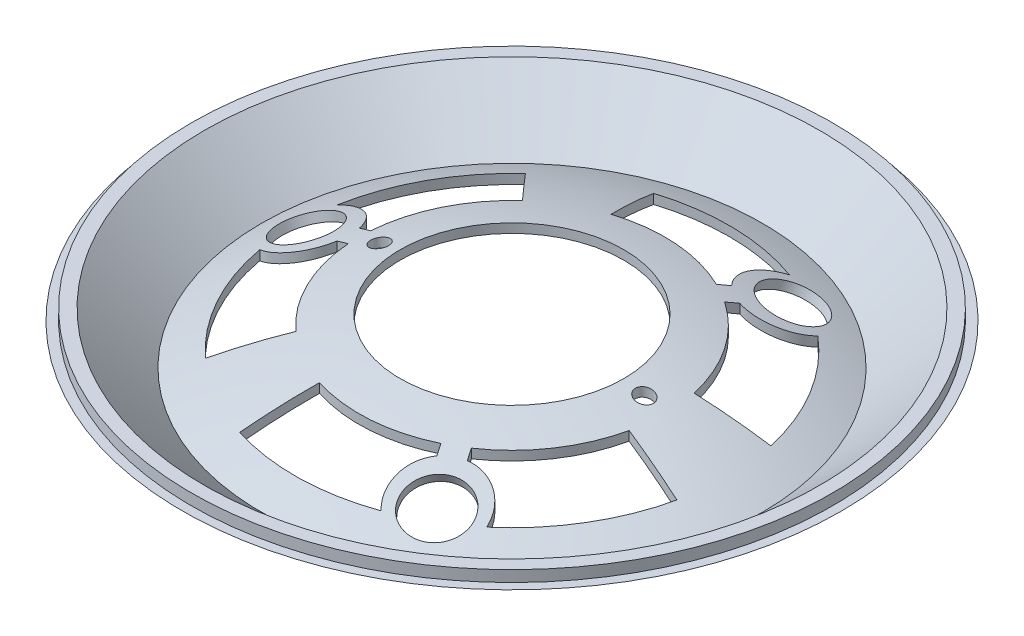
ISO-10303-21;
HEADER;
FILE_DESCRIPTION(('STEP AP214'),'2;1');
FILE_NAME('part.step','',(''),(''),'','','');
FILE_SCHEMA(('AUTOMOTIVE_DESIGN { 1 0 10303 214 1 1 1 1 }'));
ENDSEC;
DATA;
#1=APPLICATION_CONTEXT('core data for automotive mechanical design processes');
#2=APPLICATION_PROTOCOL_DEFINITION('international standard','automotive_design',2000,#1);
#3=PRODUCT_CONTEXT('',#1,'mechanical');
#4=PRODUCT('Part','Part','',(#3));
#5=PRODUCT_RELATED_PRODUCT_CATEGORY('part','',(#4));
#6=PRODUCT_DEFINITION_FORMATION('','',#4);
#7=PRODUCT_DEFINITION_CONTEXT('part definition',#1,'design');
#8=PRODUCT_DEFINITION('design','',#6,#7);
#9=PRODUCT_DEFINITION_SHAPE('','',#8);
#10=(LENGTH_UNIT() NAMED_UNIT(*) SI_UNIT(.MILLI.,.METRE.));
#11=(NAMED_UNIT(*) PLANE_ANGLE_UNIT() SI_UNIT($,.RADIAN.));
#12=(NAMED_UNIT(*) SI_UNIT($,.STERADIAN.) SOLID_ANGLE_UNIT());
#13=UNCERTAINTY_MEASURE_WITH_UNIT(LENGTH_MEASURE(1.E-05),#10,'distance_accuracy_value','');
#14=(GEOMETRIC_REPRESENTATION_CONTEXT(3) GLOBAL_UNCERTAINTY_ASSIGNED_CONTEXT((#13)) GLOBAL_UNIT_ASSIGNED_CONTEXT((#10,
#11,#12)) REPRESENTATION_CONTEXT('',''));
#15=CARTESIAN_POINT('',(0.,0.,0.));
#16=DIRECTION('',(0.,0.,1.));
#17=DIRECTION('',(1.,0.,0.));
#18=AXIS2_PLACEMENT_3D('',#15,#16,#17);
#19=CARTESIAN_POINT('',(0.,0.,0.));
#20=DIRECTION('',(0.,-1.,0.));
#21=DIRECTION('',(1.,0.,0.));
#22=AXIS2_PLACEMENT_3D('',#19,#20,#21);
#23=SPHERICAL_SURFACE('',#22,128.5);
#24=CARTESIAN_POINT('',(17.557534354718,123.264699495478,-31.7773007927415));
#25=CARTESIAN_POINT('',(17.4301159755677,123.260395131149,-31.8643981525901));
#26=CARTESIAN_POINT('',(17.3050022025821,123.254638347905,-31.9547310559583));
#27=CARTESIAN_POINT('',(17.0596824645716,123.240242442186,-32.1416197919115));
#28=CARTESIAN_POINT('',(16.9394765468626,123.231603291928,-32.2381756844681));
#29=CARTESIAN_POINT('',(16.5865535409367,123.201386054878,-32.5369033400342));
#30=CARTESIAN_POINT('',(16.3616602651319,123.175512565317,-32.7480467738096));
#31=CARTESIAN_POINT('',(15.9759471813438,123.118690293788,-33.1492079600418));
#32=CARTESIAN_POINT('',(15.8110661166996,123.089635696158,-33.3356337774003));
#33=CARTESIAN_POINT('',(15.4977599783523,123.024544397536,-33.7208183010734));
#34=CARTESIAN_POINT('',(15.3493397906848,122.988505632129,-33.9195806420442));
#35=CARTESIAN_POINT('',(15.0698458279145,122.909757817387,-34.327889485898));
#36=CARTESIAN_POINT('',(14.9387843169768,122.867044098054,-34.5374434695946));
#37=CARTESIAN_POINT('',(14.6948266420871,122.775339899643,-34.9655657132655));
#38=CARTESIAN_POINT('',(14.5819313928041,122.726349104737,-35.1841344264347));
#39=CARTESIAN_POINT('',(14.3751104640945,122.622640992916,-35.6280310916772));
#40=CARTESIAN_POINT('',(14.2811365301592,122.567938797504,-35.8533401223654));
#41=CARTESIAN_POINT('',(14.1121434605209,122.453140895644,-36.3096154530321));
#42=CARTESIAN_POINT('',(14.0371245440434,122.393045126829,-36.5405818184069));
#43=CARTESIAN_POINT('',(13.9062554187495,122.267932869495,-37.0065008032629));
#44=CARTESIAN_POINT('',(13.850400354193,122.202917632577,-37.2414523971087));
#45=CARTESIAN_POINT('',(13.7578725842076,122.068398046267,-37.7139183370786));
#46=CARTESIAN_POINT('',(13.7212067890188,121.998892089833,-37.9514335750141));
#47=CARTESIAN_POINT('',(13.6658898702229,121.852894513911,-38.4373955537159));
#48=CARTESIAN_POINT('',(13.648056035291,121.776232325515,-38.685884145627));
#49=CARTESIAN_POINT('',(13.6329738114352,121.619080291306,-39.1823841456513));
#50=CARTESIAN_POINT('',(13.6357345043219,121.538588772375,-39.4303952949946));
#51=CARTESIAN_POINT('',(13.6615626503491,121.374335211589,-39.9243079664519));
#52=CARTESIAN_POINT('',(13.6846334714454,121.290572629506,-40.1702091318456));
#53=CARTESIAN_POINT('',(13.7506944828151,121.120325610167,-40.6583699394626));
#54=CARTESIAN_POINT('',(13.7936856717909,121.033841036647,-40.9006293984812));
#55=CARTESIAN_POINT('',(13.9023226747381,120.853367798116,-41.3946291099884));
#56=CARTESIAN_POINT('',(13.9691850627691,120.759242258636,-41.6460524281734));
#57=CARTESIAN_POINT('',(14.1241285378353,120.569198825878,-42.1414720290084));
#58=CARTESIAN_POINT('',(14.2122033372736,120.473281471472,-42.3854704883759));
#59=CARTESIAN_POINT('',(14.4088322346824,120.280291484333,-42.8644763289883));
#60=CARTESIAN_POINT('',(14.5173783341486,120.18321931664,-43.0994871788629));
#61=CARTESIAN_POINT('',(14.7541440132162,119.98854473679,-43.5590480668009));
#62=CARTESIAN_POINT('',(14.8823595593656,119.890942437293,-43.7836002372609));
#63=CARTESIAN_POINT('',(15.212270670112,119.657092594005,-44.3076256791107));
#64=CARTESIAN_POINT('',(15.4229461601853,119.520863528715,-44.6015106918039));
#65=CARTESIAN_POINT('',(15.8783974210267,119.250376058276,-45.1621848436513));
#66=CARTESIAN_POINT('',(16.1231498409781,119.116116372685,-45.4289923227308));
#67=CARTESIAN_POINT('',(16.5695066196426,118.889118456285,-45.860166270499));
#68=CARTESIAN_POINT('',(16.7634722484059,118.795472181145,-46.0320281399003));
#69=CARTESIAN_POINT('',(17.1662937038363,118.610673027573,-46.3589519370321));
#70=CARTESIAN_POINT('',(17.3751522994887,118.519520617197,-46.5140107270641));
#71=CARTESIAN_POINT('',(17.8073455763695,118.340045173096,-46.806608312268));
#72=CARTESIAN_POINT('',(18.0307357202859,118.25173516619,-46.9440732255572));
#73=CARTESIAN_POINT('',(18.4898257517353,118.079025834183,-47.1995404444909));
#74=CARTESIAN_POINT('',(18.7255261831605,117.994626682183,-47.3175418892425));
#75=CARTESIAN_POINT('',(18.9666720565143,117.9125322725,-47.4252051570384));
#76=B_SPLINE_CURVE_WITH_KNOTS('',3,(#24,#25,#26,#27,#28,#29,#30,#31,#32,#33,#34,#35,#36,#37,#38,
#39,#40,#41,#42,#43,#44,#45,#46,#47,#48,#49,#50,#51,#52,#53,#54,#55,#56,#57,#58,#59,#60,#61,#62,
#63,#64,#65,#66,#67,#68,#69,#70,#71,#72,#73,#74,#75),.UNSPECIFIED.,.F.,.F.,(4,2,2,2,2,2,2,2,2,2,
2,2,2,2,2,2,2,2,2,2,2,2,2,2,2,4),(0.,0.463075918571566,0.9261563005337,1.85278391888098,
2.60361063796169,3.35465962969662,4.1062364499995,4.85785110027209,5.60752394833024,
6.35720546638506,7.10669688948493,7.85645802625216,8.63756669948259,9.41901984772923,
10.200602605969,10.9822245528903,11.8112837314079,12.6400974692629,13.4685880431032,
14.2969089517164,15.4535958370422,16.6094939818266,17.4352914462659,18.2612428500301,
19.0905561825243,19.9199061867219),.UNSPECIFIED.);
#77=CARTESIAN_POINT('',(16.1483996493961,123.144095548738,-32.9698486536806));
#78=VERTEX_POINT('',#77);
#79=CARTESIAN_POINT('',(16.3833041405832,118.983813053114,-45.6802974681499));
#80=VERTEX_POINT('',#79);
#81=EDGE_CURVE('E241',#78,#80,#76,.T.);
#82=ORIENTED_EDGE('',*,*,#81,.F.);
#83=CARTESIAN_POINT('',(-2.16506350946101,0.,-1.24999999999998));
#84=DIRECTION('',(-0.866025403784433,0.,-0.50000000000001));
#85=DIRECTION('',(-0.50000000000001,0.,0.866025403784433));
#86=AXIS2_PLACEMENT_3D('',#83,#84,#85);
#87=CIRCLE('',#86,128.475678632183);
#88=CARTESIAN_POINT('',(14.9012583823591,123.858639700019,-30.8097366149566));
#89=VERTEX_POINT('',#88);
#90=EDGE_CURVE('E230',#89,#78,#87,.T.);
#91=ORIENTED_EDGE('',*,*,#90,.F.);
#92=CARTESIAN_POINT('',(0.,123.858639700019,0.));
#93=DIRECTION('',(0.,-1.,0.));
#94=DIRECTION('',(0.,0.,-1.));
#95=AXIS2_PLACEMENT_3D('',#92,#93,#94);
#96=CIRCLE('',#95,34.2240759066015);
#97=CARTESIAN_POINT('',(-10.4417881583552,123.858639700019,-32.592275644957));
#98=VERTEX_POINT('',#97);
#99=EDGE_CURVE('E235',#98,#89,#96,.T.);
#100=ORIENTED_EDGE('',*,*,#99,.F.);
#101=CARTESIAN_POINT('',(-0.499261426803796,0.,0.151598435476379));
#102=DIRECTION('',(0.956860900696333,0.,-0.290546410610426));
#103=DIRECTION('',(-0.290546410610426,0.,-0.956860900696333));
#104=AXIS2_PLACEMENT_3D('',#101,#102,#103);
#105=CIRCLE('',#104,128.498940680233);
#106=CARTESIAN_POINT('',(-14.5984881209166,118.983813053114,-46.2815986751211));
#107=VERTEX_POINT('',#106);
#108=EDGE_CURVE('E255',#107,#98,#105,.T.);
#109=ORIENTED_EDGE('',*,*,#108,.F.);
#110=CARTESIAN_POINT('',(0.,118.983813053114,0.));
#111=DIRECTION('',(0.,-1.,0.));
#112=DIRECTION('',(0.,0.,-1.));
#113=AXIS2_PLACEMENT_3D('',#110,#111,#112);
#114=CIRCLE('',#113,48.5293955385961);
#115=EDGE_CURVE('E250',#80,#107,#114,.F.);
#116=ORIENTED_EDGE('',*,*,#115,.F.);
#117=EDGE_LOOP('',(#82,#91,#100,#109,#116));
#118=FACE_BOUND('',#117,.T.);
#119=CARTESIAN_POINT('',(-36.6268684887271,123.144116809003,2.4997999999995));
#120=CARTESIAN_POINT('',(-36.6961777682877,123.118635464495,2.73963655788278));
#121=CARTESIAN_POINT('',(-36.7754177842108,123.089496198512,2.97618457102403));
#122=CARTESIAN_POINT('',(-36.952806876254,123.024234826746,3.44100247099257));
#123=CARTESIAN_POINT('',(-37.0509499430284,122.988114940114,3.66927496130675));
#124=CARTESIAN_POINT('',(-37.2649181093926,122.909326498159,4.11532843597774));
#125=CARTESIAN_POINT('',(-37.3806895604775,122.866677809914,4.33313870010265));
#126=CARTESIAN_POINT('',(-37.6290502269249,122.775130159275,4.75757715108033));
#127=CARTESIAN_POINT('',(-37.7616403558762,122.726230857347,4.96420472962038));
#128=CARTESIAN_POINT('',(-38.0423132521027,122.622649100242,5.36477009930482));
#129=CARTESIAN_POINT('',(-38.1903796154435,122.567972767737,5.55872097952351));
#130=CARTESIAN_POINT('',(-38.5009312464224,122.453211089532,5.93311523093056));
#131=CARTESIAN_POINT('',(-38.6634217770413,122.393123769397,6.11355362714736));
#132=CARTESIAN_POINT('',(-39.0015274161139,122.267995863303,6.45991872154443));
#133=CARTESIAN_POINT('',(-39.1771461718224,122.20295390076,6.62584135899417));
#134=CARTESIAN_POINT('',(-39.5401521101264,122.06839639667,6.94229687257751));
#135=CARTESIAN_POINT('',(-39.7275401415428,121.998880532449,7.09282863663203));
#136=CARTESIAN_POINT('',(-40.120818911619,121.852852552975,7.38377101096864));
#137=CARTESIAN_POINT('',(-40.3271560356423,121.776169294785,7.52349243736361));
#138=CARTESIAN_POINT('',(-40.7496263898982,121.619006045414,7.78480507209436));
#139=CARTESIAN_POINT('',(-40.9657598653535,121.538525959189,7.90639582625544));
#140=CARTESIAN_POINT('',(-41.406375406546,121.374287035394,8.1309547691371));
#141=CARTESIAN_POINT('',(-41.6308597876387,121.290527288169,8.23391774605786));
#142=CARTESIAN_POINT('',(-42.0866289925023,121.120288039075,8.42077182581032));
#143=CARTESIAN_POINT('',(-42.3179140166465,121.033808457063,8.50466236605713));
#144=CARTESIAN_POINT('',(-42.7999969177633,120.853354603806,8.65755872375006));
#145=CARTESIAN_POINT('',(-43.0511280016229,120.759243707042,8.72535471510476));
#146=CARTESIAN_POINT('',(-43.5575667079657,120.569229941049,8.83886480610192));
#147=CARTESIAN_POINT('',(-43.8128730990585,120.473327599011,8.88458529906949));
#148=CARTESIAN_POINT('',(-44.326021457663,120.280336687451,8.95381146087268));
#149=CARTESIAN_POINT('',(-44.5838632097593,120.18324821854,8.97731900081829));
#150=CARTESIAN_POINT('',(-45.1003088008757,119.988546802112,9.00206272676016));
#151=CARTESIAN_POINT('',(-45.3589124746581,119.890933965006,9.00330343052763));
#152=CARTESIAN_POINT('',(-45.9778883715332,119.65700797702,8.97958357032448));
#153=CARTESIAN_POINT('',(-46.3379391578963,119.520702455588,8.94403467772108));
#154=CARTESIAN_POINT('',(-46.872910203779,119.317833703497,8.85844619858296));
#155=CARTESIAN_POINT('',(-47.0502915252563,119.250510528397,8.82456534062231));
#156=CARTESIAN_POINT('',(-47.4029298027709,119.116558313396,8.74613392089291));
#157=CARTESIAN_POINT('',(-47.5781869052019,119.049929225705,8.70158409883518));
#158=CARTESIAN_POINT('',(-47.7521501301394,118.983736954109,8.65173383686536));
#159=B_SPLINE_CURVE_WITH_KNOTS('',3,(#119,#120,#121,#122,#123,#124,#125,#126,#127,#128,#129,
#130,#131,#132,#133,#134,#135,#136,#137,#138,#139,#140,#141,#142,#143,#144,#145,#146,#147,#148,
#149,#150,#151,#152,#153,#154,#155,#156,#157,#158),.UNSPECIFIED.,.F.,.F.,(4,2,2,2,2,2,2,2,2,2,2,
2,2,2,2,2,2,2,2,4),(0.,0.752559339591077,1.50487983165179,2.25495492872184,3.00507078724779,
3.75439947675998,4.50400270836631,5.25381497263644,6.00368137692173,6.78499463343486,
7.56632745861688,8.34787855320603,9.1294526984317,9.95838198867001,10.787071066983,
11.6156903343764,12.4441414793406,13.6012097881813,14.1791393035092,14.7570287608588),.UNSPECIFIED.);
#160=CARTESIAN_POINT('',(-36.6269263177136,123.144095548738,2.4999999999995));
#161=VERTEX_POINT('',#160);
#162=CARTESIAN_POINT('',(-47.7519501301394,118.983813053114,8.65179115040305));
#163=VERTEX_POINT('',#162);
#164=EDGE_CURVE('E337',#161,#163,#159,.T.);
#165=ORIENTED_EDGE('',*,*,#164,.F.);
#166=CARTESIAN_POINT('',(0.,0.,2.50000000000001));
#167=DIRECTION('',(0.,0.,1.));
#168=DIRECTION('',(1.,0.,0.));
#169=AXIS2_PLACEMENT_3D('',#166,#167,#168);
#170=CIRCLE('',#169,128.475678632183);
#171=CARTESIAN_POINT('',(-34.1326437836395,123.858639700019,2.49999999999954));
#172=VERTEX_POINT('',#171);
#173=EDGE_CURVE('E328',#172,#161,#170,.T.);
#174=ORIENTED_EDGE('',*,*,#173,.F.);
#175=CARTESIAN_POINT('',(0.,123.858639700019,0.));
#176=DIRECTION('',(0.,-1.,0.));
#177=DIRECTION('',(0.,0.,-1.));
#178=AXIS2_PLACEMENT_3D('',#175,#176,#177);
#179=CIRCLE('',#178,34.2240759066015);
#180=CARTESIAN_POINT('',(-23.0048445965,123.858639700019,25.3389916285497));
#181=VERTEX_POINT('',#180);
#182=EDGE_CURVE('E330',#181,#172,#179,.T.);
#183=ORIENTED_EDGE('',*,*,#182,.F.);
#184=CARTESIAN_POINT('',(0.38091880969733,0.,0.356573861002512));
#185=DIRECTION('',(-0.730051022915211,0.,-0.683392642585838));
#186=DIRECTION('',(-0.683392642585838,0.,0.730051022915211));
#187=AXIS2_PLACEMENT_3D('',#184,#185,#186);
#188=CIRCLE('',#187,128.498940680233);
#189=CARTESIAN_POINT('',(-32.7817961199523,118.983813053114,35.7834609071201));
#190=VERTEX_POINT('',#189);
#191=EDGE_CURVE('E333',#190,#181,#188,.T.);
#192=ORIENTED_EDGE('',*,*,#191,.F.);
#193=CARTESIAN_POINT('',(0.,118.983813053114,0.));
#194=DIRECTION('',(0.,-1.,0.));
#195=DIRECTION('',(0.,0.,-1.));
#196=AXIS2_PLACEMENT_3D('',#193,#194,#195);
#197=CIRCLE('',#196,48.5293955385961);
#198=EDGE_CURVE('E335',#163,#190,#197,.F.);
#199=ORIENTED_EDGE('',*,*,#198,.F.);
#200=EDGE_LOOP('',(#165,#174,#183,#192,#199));
#201=FACE_BOUND('',#200,.T.);
#202=CARTESIAN_POINT('',(20.4783266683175,123.144116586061,30.4698980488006));
#203=CARTESIAN_POINT('',(20.7206858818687,123.118635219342,30.4100034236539));
#204=CARTESIAN_POINT('',(20.9651624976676,123.089495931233,30.3603533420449));
#205=CARTESIAN_POINT('',(21.456401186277,123.024234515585,30.2815679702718));
#206=CARTESIAN_POINT('',(21.703162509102,122.988114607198,30.2524261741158));
#207=CARTESIAN_POINT('',(22.1964402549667,122.909326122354,30.2147014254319));
#208=CARTESIAN_POINT('',(22.4429552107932,122.866677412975,30.2060573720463));
#209=CARTESIAN_POINT('',(22.9347100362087,122.775129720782,30.2089249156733));
#210=CARTESIAN_POINT('',(23.1799498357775,122.726230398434,30.2204376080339));
#211=CARTESIAN_POINT('',(23.6671860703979,122.622648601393,30.2632249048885));
#212=CARTESIAN_POINT('',(23.9091856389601,122.567972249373,30.2944787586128));
#213=CARTESIAN_POINT('',(24.3886963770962,122.453210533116,30.3762273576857));
#214=CARTESIAN_POINT('',(24.6262058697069,122.393123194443,30.426729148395));
#215=CARTESIAN_POINT('',(25.095219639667,122.267995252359,30.5463547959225));
#216=CARTESIAN_POINT('',(25.326722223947,122.202953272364,30.6154838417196));
#217=CARTESIAN_POINT('',(25.7822836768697,122.068395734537,30.7716285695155));
#218=CARTESIAN_POINT('',(26.0063420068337,121.998879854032,30.858645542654));
#219=CARTESIAN_POINT('',(26.4549448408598,121.85285184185,31.0537638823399));
#220=CARTESIAN_POINT('',(26.6791156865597,121.776168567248,31.1625964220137));
#221=CARTESIAN_POINT('',(27.1166541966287,121.619005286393,31.3978102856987));
#222=CARTESIAN_POINT('',(27.3300215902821,121.538525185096,31.5241920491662));
#223=CARTESIAN_POINT('',(27.7448030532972,121.374286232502,31.7934969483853));
#224=CARTESIAN_POINT('',(27.9462137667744,121.290526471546,31.9364246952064));
#225=CARTESIAN_POINT('',(28.3359186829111,121.120287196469,32.2377054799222));
#226=CARTESIAN_POINT('',(28.5242124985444,121.033807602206,32.3960589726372));
#227=CARTESIAN_POINT('',(28.8976660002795,120.853353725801,32.737106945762));
#228=CARTESIAN_POINT('',(29.0819445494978,120.759242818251,32.920694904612));
#229=CARTESIAN_POINT('',(29.4334664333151,120.569229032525,33.3025287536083));
#230=CARTESIAN_POINT('',(29.6007146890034,120.47332668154,33.5007703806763));
#231=CARTESIAN_POINT('',(29.9172403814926,120.2803357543,33.9105569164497));
#232=CARTESIAN_POINT('',(30.0665193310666,120.183247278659,34.1221007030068));
#233=CARTESIAN_POINT('',(30.3461707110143,119.988545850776,34.5569839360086));
#234=CARTESIAN_POINT('',(30.476546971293,119.890933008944,34.7803209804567));
#235=CARTESIAN_POINT('',(30.7654924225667,119.657007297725,35.3282291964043));
#236=CARTESIAN_POINT('',(30.9147312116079,119.520702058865,35.6578161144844));
#237=CARTESIAN_POINT('',(31.108094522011,119.317833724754,36.1639078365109));
#238=CARTESIAN_POINT('',(31.167443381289,119.250510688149,36.3344646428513));
#239=CARTESIAN_POINT('',(31.2758387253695,119.1165587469,36.6790733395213));
#240=CARTESIAN_POINT('',(31.3248859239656,119.049929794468,36.8531249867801));
#241=CARTESIAN_POINT('',(31.3686958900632,118.983737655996,37.0287063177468));
#242=B_SPLINE_CURVE_WITH_KNOTS('',3,(#202,#203,#204,#205,#206,#207,#208,#209,#210,#211,#212,
#213,#214,#215,#216,#217,#218,#219,#220,#221,#222,#223,#224,#225,#226,#227,#228,#229,#230,#231,
#232,#233,#234,#235,#236,#237,#238,#239,#240,#241),.UNSPECIFIED.,.F.,.F.,(4,2,2,2,2,2,2,2,2,2,2,
2,2,2,2,2,2,2,2,4),(0.,0.752559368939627,1.50487989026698,2.2549550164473,3.00507090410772,
3.75439962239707,4.50400288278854,5.25381517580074,6.00368160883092,6.78499490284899,
7.56632776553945,8.34787889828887,9.12945308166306,9.95838240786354,10.7870715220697,
11.6156908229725,12.4441420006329,13.6012079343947,14.1791362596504,14.7570245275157),.UNSPECIFIED.);
#243=CARTESIAN_POINT('',(20.4785266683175,123.144095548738,30.4698486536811));
#244=VERTEX_POINT('',#243);
#245=CARTESIAN_POINT('',(31.3686459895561,118.983813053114,37.0285063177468));
#246=VERTEX_POINT('',#245);
#247=EDGE_CURVE('E1031',#244,#246,#242,.T.);
#248=ORIENTED_EDGE('',*,*,#247,.F.);
#249=CARTESIAN_POINT('',(2.16506350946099,0.,-1.24999999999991));
#250=DIRECTION('',(0.866025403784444,0.,-0.499999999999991));
#251=DIRECTION('',(-0.499999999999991,0.,-0.866025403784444));
#252=AXIS2_PLACEMENT_3D('',#249,#250,#251);
#253=CIRCLE('',#252,128.475678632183);
#254=CARTESIAN_POINT('',(19.2313854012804,123.858639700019,28.3097366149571));
#255=VERTEX_POINT('',#254);
#256=EDGE_CURVE('E1071',#255,#244,#253,.T.);
#257=ORIENTED_EDGE('',*,*,#256,.F.);
#258=CARTESIAN_POINT('',(0.,123.858639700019,0.));
#259=DIRECTION('',(0.,-1.,0.));
#260=DIRECTION('',(0.,0.,-1.));
#261=AXIS2_PLACEMENT_3D('',#258,#259,#260);
#262=CIRCLE('',#261,34.2240759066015);
#263=CARTESIAN_POINT('',(33.4466327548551,123.858639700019,7.25328401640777));
#264=VERTEX_POINT('',#263);
#265=EDGE_CURVE('E1068',#264,#255,#262,.T.);
#266=ORIENTED_EDGE('',*,*,#265,.F.);
#267=CARTESIAN_POINT('',(0.11834261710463,0.,-0.508172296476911));
#268=DIRECTION('',(-0.226809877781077,0.,0.973939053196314));
#269=DIRECTION('',(0.973939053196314,0.,0.226809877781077));
#270=AXIS2_PLACEMENT_3D('',#267,#268,#269);
#271=CIRCLE('',#270,128.498940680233);
#272=CARTESIAN_POINT('',(47.3802842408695,118.983813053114,10.4981377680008));
#273=VERTEX_POINT('',#272);
#274=EDGE_CURVE('E1066',#273,#264,#271,.T.);
#275=ORIENTED_EDGE('',*,*,#274,.F.);
#276=CARTESIAN_POINT('',(0.,118.983813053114,0.));
#277=DIRECTION('',(0.,-1.,0.));
#278=DIRECTION('',(0.,0.,-1.));
#279=AXIS2_PLACEMENT_3D('',#276,#277,#278);
#280=CIRCLE('',#279,48.5293955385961);
#281=EDGE_CURVE('E1038',#246,#273,#280,.F.);
#282=ORIENTED_EDGE('',*,*,#281,.F.);
#283=EDGE_LOOP('',(#248,#257,#266,#275,#282));
#284=FACE_BOUND('',#283,.T.);
#285=CARTESIAN_POINT('',(0.,115.65830249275,0.));
#286=DIRECTION('',(0.,-1.,0.));
#287=DIRECTION('',(1.,0.,0.));
#288=AXIS2_PLACEMENT_3D('',#285,#286,#287);
#289=CIRCLE('',#288,55.9947056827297);
#290=CARTESIAN_POINT('',(55.9947056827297,115.65830249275,0.));
#291=VERTEX_POINT('',#290);
#292=EDGE_CURVE('E514',#291,#291,#289,.T.);
#293=ORIENTED_EDGE('',*,*,#292,.F.);
#294=EDGE_LOOP('',(#293));
#295=FACE_BOUND('',#294,.T.);
#296=CARTESIAN_POINT('',(31.0747381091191,124.67872915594,-1.35098020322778));
#297=CARTESIAN_POINT('',(30.9975195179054,124.697061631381,-1.43526424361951));
#298=CARTESIAN_POINT('',(30.9131725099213,124.717082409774,-1.51278606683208));
#299=CARTESIAN_POINT('',(30.7328740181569,124.759866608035,-1.65215571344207));
#300=CARTESIAN_POINT('',(30.6369048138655,124.782634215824,-1.71397914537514));
#301=CARTESIAN_POINT('',(30.4364241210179,124.830181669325,-1.82023063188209));
#302=CARTESIAN_POINT('',(30.3319256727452,124.85495844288,-1.86468466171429));
#303=CARTESIAN_POINT('',(30.1172632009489,124.905839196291,-1.93525312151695));
#304=CARTESIAN_POINT('',(30.007100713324,124.93194281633,-1.96137249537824));
#305=CARTESIAN_POINT('',(29.7822302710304,124.985209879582,-1.99497587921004));
#306=CARTESIAN_POINT('',(29.6674771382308,125.012383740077,-2.00214157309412));
#307=CARTESIAN_POINT('',(29.4383943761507,125.066613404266,-1.9967507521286));
#308=CARTESIAN_POINT('',(29.3240648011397,125.093669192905,-1.98419179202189));
#309=CARTESIAN_POINT('',(29.0981283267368,125.147119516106,-1.93945667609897));
#310=CARTESIAN_POINT('',(28.9865508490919,125.173506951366,-1.90712301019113));
#311=CARTESIAN_POINT('',(28.7703347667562,125.224625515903,-1.82348295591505));
#312=CARTESIAN_POINT('',(28.6656959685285,125.249356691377,-1.7721770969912));
#313=CARTESIAN_POINT('',(28.4674770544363,125.296192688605,-1.65247288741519));
#314=CARTESIAN_POINT('',(28.3737997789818,125.31832059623,-1.58424463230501));
#315=CARTESIAN_POINT('',(28.1992595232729,125.359539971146,-1.43224050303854));
#316=CARTESIAN_POINT('',(28.1183949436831,125.378631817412,-1.34846657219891));
#317=CARTESIAN_POINT('',(27.9738277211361,125.412757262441,-1.1698120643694));
#318=CARTESIAN_POINT('',(27.909769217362,125.427875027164,-1.07523562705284));
#319=CARTESIAN_POINT('',(27.7985055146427,125.454129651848,-0.87613687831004));
#320=CARTESIAN_POINT('',(27.751297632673,125.465267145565,-0.771616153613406));
#321=CARTESIAN_POINT('',(27.6763499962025,125.482947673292,-0.558559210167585));
#322=CARTESIAN_POINT('',(27.6481309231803,125.489603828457,-0.450200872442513));
#323=CARTESIAN_POINT('',(27.6101489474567,125.498562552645,-0.230124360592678));
#324=CARTESIAN_POINT('',(27.6003838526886,125.500865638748,-0.118406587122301));
#325=CARTESIAN_POINT('',(27.5996447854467,125.501039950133,0.103149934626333));
#326=CARTESIAN_POINT('',(27.6083481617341,125.498987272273,0.212987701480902));
#327=CARTESIAN_POINT('',(27.6436026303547,125.490671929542,0.429591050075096));
#328=CARTESIAN_POINT('',(27.6701532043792,125.484409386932,0.536356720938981));
#329=CARTESIAN_POINT('',(27.7402050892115,125.467884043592,0.7437275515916));
#330=CARTESIAN_POINT('',(27.7836909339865,125.457624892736,0.844338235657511));
#331=CARTESIAN_POINT('',(27.8862428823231,125.433426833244,1.03678715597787));
#332=CARTESIAN_POINT('',(27.945309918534,125.419487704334,1.12862486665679));
#333=CARTESIAN_POINT('',(28.0782624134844,125.388105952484,1.30248806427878));
#334=CARTESIAN_POINT('',(28.1523630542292,125.370612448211,1.38433970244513));
#335=CARTESIAN_POINT('',(28.3125913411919,125.332776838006,1.53448292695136));
#336=CARTESIAN_POINT('',(28.3987204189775,125.312434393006,1.60277289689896));
#337=CARTESIAN_POINT('',(28.5828675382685,125.268929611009,1.72568853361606));
#338=CARTESIAN_POINT('',(28.681130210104,125.245709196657,1.77992711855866));
#339=CARTESIAN_POINT('',(28.884964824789,125.197526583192,1.87114869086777));
#340=CARTESIAN_POINT('',(28.9905377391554,125.172564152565,1.90812937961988));
#341=CARTESIAN_POINT('',(29.2087598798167,125.120949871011,1.96467348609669));
#342=CARTESIAN_POINT('',(29.321518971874,125.094271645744,1.9837893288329));
#343=CARTESIAN_POINT('',(29.5485607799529,125.040537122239,2.00258153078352));
#344=CARTESIAN_POINT('',(29.662843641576,125.013480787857,2.0022560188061));
#345=CARTESIAN_POINT('',(29.8913021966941,124.959376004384,1.98203601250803));
#346=CARTESIAN_POINT('',(30.0054560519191,124.93233249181,1.96188008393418));
#347=CARTESIAN_POINT('',(30.2288307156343,124.879397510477,1.90208819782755));
#348=CARTESIAN_POINT('',(30.3380514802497,124.853506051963,1.86245206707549));
#349=CARTESIAN_POINT('',(30.5479476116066,124.803734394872,1.76486199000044));
#350=CARTESIAN_POINT('',(30.6486543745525,124.779846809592,1.70697943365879));
#351=CARTESIAN_POINT('',(30.838928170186,124.734702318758,1.57432611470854));
#352=CARTESIAN_POINT('',(30.928496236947,124.713445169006,1.49955692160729));
#353=CARTESIAN_POINT('',(31.0919916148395,124.674634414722,1.33678818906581));
#354=CARTESIAN_POINT('',(31.1661941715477,124.657015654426,1.24908082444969));
#355=CARTESIAN_POINT('',(31.2987414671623,124.625538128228,1.06180542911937));
#356=CARTESIAN_POINT('',(31.3570886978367,124.611678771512,0.962239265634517));
#357=CARTESIAN_POINT('',(31.4546100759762,124.588511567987,0.756958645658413));
#358=CARTESIAN_POINT('',(31.4942584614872,124.579091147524,0.651482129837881));
#359=CARTESIAN_POINT('',(31.5553307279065,124.564579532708,0.435101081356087));
#360=CARTESIAN_POINT('',(31.5767579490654,124.55948754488,0.324197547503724));
#361=CARTESIAN_POINT('',(31.6003983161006,124.553869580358,0.102691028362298));
#362=CARTESIAN_POINT('',(31.6030181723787,124.553246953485,-0.00786629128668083));
#363=CARTESIAN_POINT('',(31.5900292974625,124.556333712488,-0.227870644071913));
#364=CARTESIAN_POINT('',(31.5744168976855,124.560043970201,-0.337317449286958));
#365=CARTESIAN_POINT('',(31.5256335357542,124.57163612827,-0.551280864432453));
#366=CARTESIAN_POINT('',(31.4925685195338,124.579492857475,-0.655823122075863));
#367=CARTESIAN_POINT('',(31.410026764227,124.599103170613,-0.857711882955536));
#368=CARTESIAN_POINT('',(31.3605699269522,124.610852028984,-0.955066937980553));
#369=CARTESIAN_POINT('',(31.2704036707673,124.632267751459,-1.10173148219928));
#370=CARTESIAN_POINT('',(31.2345391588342,124.64078531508,-1.15425604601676));
#371=CARTESIAN_POINT('',(31.1580913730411,124.658939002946,-1.2555386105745));
#372=CARTESIAN_POINT('',(31.1175081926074,124.668575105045,-1.30429668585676));
#373=CARTESIAN_POINT('',(31.0747381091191,124.67872915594,-1.35098020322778));
#374=B_SPLINE_CURVE_WITH_KNOTS('',3,(#296,#297,#298,#299,#300,#301,#302,#303,#304,#305,#306,
#307,#308,#309,#310,#311,#312,#313,#314,#315,#316,#317,#318,#319,#320,#321,#322,#323,#324,#325,
#326,#327,#328,#329,#330,#331,#332,#333,#334,#335,#336,#337,#338,#339,#340,#341,#342,#343,#344,
#345,#346,#347,#348,#349,#350,#351,#352,#353,#354,#355,#356,#357,#358,#359,#360,#361,#362,#363,
#364,#365,#366,#367,#368,#369,#370,#371,#372,#373),.UNSPECIFIED.,.T.,.F.,(4,2,2,2,2,2,2,2,2,2,2,
2,2,2,2,2,2,2,2,2,2,2,2,2,2,2,2,2,2,2,2,2,2,2,2,2,2,2,4),(0.,0.347067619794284,
0.694671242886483,1.04175303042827,1.38874119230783,1.74152087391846,2.09434429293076,
2.45001530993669,2.80567640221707,3.15789798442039,3.51007556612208,3.8540503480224,
4.19797033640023,4.53284603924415,4.86768196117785,5.19671637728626,5.52574123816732,
5.85446632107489,6.18321108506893,6.51704347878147,6.85091563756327,7.19318916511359,
7.53550826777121,7.88619022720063,8.23690593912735,8.59230812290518,8.94771346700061,
9.30174517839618,9.65574399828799,10.0027139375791,10.3496293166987,10.6871974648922,
11.0247037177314,11.3548887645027,11.6851402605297,12.0134096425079,12.3412819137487,
12.533520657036,12.7257555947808),.UNSPECIFIED.);
#375=CARTESIAN_POINT('',(31.0747381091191,124.67872915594,-1.35098020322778));
#376=VERTEX_POINT('',#375);
#377=EDGE_CURVE('E925',#376,#376,#374,.T.);
#378=ORIENTED_EDGE('',*,*,#377,.F.);
#379=EDGE_LOOP('',(#378));
#380=FACE_BOUND('',#379,.T.);
#381=CARTESIAN_POINT('',(22.9952090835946,119.809135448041,39.828870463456));
#382=DIRECTION('',(-0.179183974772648,-0.933580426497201,-0.310355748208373));
#383=DIRECTION('',(-0.466790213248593,0.358367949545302,-0.808504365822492));
#384=AXIS2_PLACEMENT_3D('',#381,#382,#383);
#385=CIRCLE('',#384,6.55);
#386=CARTESIAN_POINT('',(19.9377331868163,122.156445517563,34.5331668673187));
#387=VERTEX_POINT('',#386);
#388=EDGE_CURVE('E495',#387,#387,#385,.F.);
#389=ORIENTED_EDGE('',*,*,#388,.F.);
#390=EDGE_LOOP('',(#389));
#391=FACE_BOUND('',#390,.T.);
#392=CARTESIAN_POINT('',(-45.9904181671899,119.809135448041,0.));
#393=DIRECTION('',(0.358367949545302,-0.933580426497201,0.));
#394=DIRECTION('',(0.933580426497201,0.358367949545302,0.));
#395=AXIS2_PLACEMENT_3D('',#392,#393,#394);
#396=CIRCLE('',#395,6.55);
#397=CARTESIAN_POINT('',(-39.8754663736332,122.156445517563,0.));
#398=VERTEX_POINT('',#397);
#399=EDGE_CURVE('E511',#398,#398,#396,.F.);
#400=ORIENTED_EDGE('',*,*,#399,.F.);
#401=EDGE_LOOP('',(#400));
#402=FACE_BOUND('',#401,.T.);
#403=CARTESIAN_POINT('',(22.9952090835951,119.809135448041,-39.8288704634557));
#404=DIRECTION('',(-0.179183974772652,-0.933580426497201,0.31035574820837));
#405=DIRECTION('',(-0.466790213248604,0.358367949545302,0.808504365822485));
#406=AXIS2_PLACEMENT_3D('',#403,#404,#405);
#407=CIRCLE('',#406,6.55);
#408=CARTESIAN_POINT('',(19.9377331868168,122.156445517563,-34.5331668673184));
#409=VERTEX_POINT('',#408);
#410=EDGE_CURVE('E505',#409,#409,#407,.F.);
#411=ORIENTED_EDGE('',*,*,#410,.F.);
#412=EDGE_LOOP('',(#411));
#413=FACE_BOUND('',#412,.T.);
#414=CARTESIAN_POINT('',(-31.2996193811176,124.625328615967,-1.054179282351));
#415=CARTESIAN_POINT('',(-31.3572898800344,124.611631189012,-0.961190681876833));
#416=CARTESIAN_POINT('',(-31.4074653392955,124.599711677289,-0.863210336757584));
#417=CARTESIAN_POINT('',(-31.4911893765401,124.579820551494,-0.659928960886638));
#418=CARTESIAN_POINT('',(-31.5247226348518,124.571852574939,-0.554621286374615));
#419=CARTESIAN_POINT('',(-31.5740267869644,124.560136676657,-0.339667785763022));
#420=CARTESIAN_POINT('',(-31.5897947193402,124.556389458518,-0.230021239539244));
#421=CARTESIAN_POINT('',(-31.6030220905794,124.553246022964,-0.00959078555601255));
#422=CARTESIAN_POINT('',(-31.6004854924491,124.553848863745,0.101192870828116));
#423=CARTESIAN_POINT('',(-31.5772964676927,124.559359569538,0.319819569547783));
#424=CARTESIAN_POINT('',(-31.5567917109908,124.564232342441,0.4276792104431));
#425=CARTESIAN_POINT('',(-31.4985378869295,124.578074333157,0.638357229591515));
#426=CARTESIAN_POINT('',(-31.4607882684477,124.587043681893,0.741175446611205));
#427=CARTESIAN_POINT('',(-31.3690185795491,124.60884486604,0.939450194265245));
#428=CARTESIAN_POINT('',(-31.3149185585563,124.621695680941,1.03486758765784));
#429=CARTESIAN_POINT('',(-31.1921890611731,124.650842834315,1.21525222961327));
#430=CARTESIAN_POINT('',(-31.1235583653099,124.667139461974,1.30021860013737));
#431=CARTESIAN_POINT('',(-30.9722879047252,124.703050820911,1.45914347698));
#432=CARTESIAN_POINT('',(-30.8893952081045,124.722725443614,1.53284758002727));
#433=CARTESIAN_POINT('',(-30.7130099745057,124.764579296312,1.66534712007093));
#434=CARTESIAN_POINT('',(-30.6195160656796,124.786758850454,1.72414062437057));
#435=CARTESIAN_POINT('',(-30.4219372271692,124.833616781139,1.82678293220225));
#436=CARTESIAN_POINT('',(-30.3176376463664,124.858345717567,1.87019554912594));
#437=CARTESIAN_POINT('',(-30.1035167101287,124.90909676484,1.93884396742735));
#438=CARTESIAN_POINT('',(-29.9936946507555,124.935119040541,1.96407744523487));
#439=CARTESIAN_POINT('',(-29.7690876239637,124.98832239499,1.99613492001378));
#440=CARTESIAN_POINT('',(-29.6542466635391,125.015516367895,2.00254631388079));
#441=CARTESIAN_POINT('',(-29.4251190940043,125.069755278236,1.99563419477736));
#442=CARTESIAN_POINT('',(-29.3108325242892,125.096800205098,1.98230929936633));
#443=CARTESIAN_POINT('',(-29.0851494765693,125.150189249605,1.93605206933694));
#444=CARTESIAN_POINT('',(-28.9737820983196,125.176526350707,1.90296925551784));
#445=CARTESIAN_POINT('',(-28.7581095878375,125.227515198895,1.81787177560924));
#446=CARTESIAN_POINT('',(-28.6538042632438,125.252166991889,1.76585762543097));
#447=CARTESIAN_POINT('',(-28.4564000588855,125.298809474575,1.64482491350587));
#448=CARTESIAN_POINT('',(-28.3631995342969,125.320824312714,1.57598161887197));
#449=CARTESIAN_POINT('',(-28.1897112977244,125.361794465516,1.42283797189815));
#450=CARTESIAN_POINT('',(-28.1094219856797,125.380750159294,1.33853953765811));
#451=CARTESIAN_POINT('',(-27.9660869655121,125.414584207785,1.15897183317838));
#452=CARTESIAN_POINT('',(-27.9026808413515,125.429547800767,1.06400641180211));
#453=CARTESIAN_POINT('',(-27.7927764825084,125.455481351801,0.864252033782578));
#454=CARTESIAN_POINT('',(-27.746275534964,125.46645195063,0.759464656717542));
#455=CARTESIAN_POINT('',(-27.6727511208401,125.483796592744,0.546004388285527));
#456=CARTESIAN_POINT('',(-27.6452487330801,125.490283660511,0.437505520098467));
#457=CARTESIAN_POINT('',(-27.6087076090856,125.498902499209,0.21727646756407));
#458=CARTESIAN_POINT('',(-27.5996667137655,125.501034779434,0.105546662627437));
#459=CARTESIAN_POINT('',(-27.6003463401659,125.500874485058,-0.115937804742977));
#460=CARTESIAN_POINT('',(-27.6097494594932,125.498656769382,-0.225693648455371));
#461=CARTESIAN_POINT('',(-27.6463736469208,125.490018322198,-0.442015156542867));
#462=CARTESIAN_POINT('',(-27.6735942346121,125.483597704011,-0.548580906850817));
#463=CARTESIAN_POINT('',(-27.7449474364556,125.466765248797,-0.755479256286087));
#464=CARTESIAN_POINT('',(-27.7890704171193,125.456355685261,-0.855815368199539));
#465=CARTESIAN_POINT('',(-27.8928394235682,125.431870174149,-1.04761354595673));
#466=CARTESIAN_POINT('',(-27.9524863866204,125.417794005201,-1.13907507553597));
#467=CARTESIAN_POINT('',(-28.086552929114,125.386148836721,-1.31211452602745));
#468=CARTESIAN_POINT('',(-28.1611902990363,125.368528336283,-1.39351417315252));
#469=CARTESIAN_POINT('',(-28.3224119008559,125.330457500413,-1.54267093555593));
#470=CARTESIAN_POINT('',(-28.4089975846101,125.310006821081,-1.61042639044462));
#471=CARTESIAN_POINT('',(-28.5939859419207,125.266302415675,-1.73219625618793));
#472=CARTESIAN_POINT('',(-28.6926318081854,125.242990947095,-1.78582046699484));
#473=CARTESIAN_POINT('',(-28.8971307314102,125.194650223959,-1.87575505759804));
#474=CARTESIAN_POINT('',(-29.002984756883,125.16962073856,-1.91206310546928));
#475=CARTESIAN_POINT('',(-29.2216541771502,125.117899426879,-1.96719945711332));
#476=CARTESIAN_POINT('',(-29.3345762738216,125.091181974,-1.98558107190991));
#477=CARTESIAN_POINT('',(-29.5618194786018,125.037398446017,-2.00288034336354));
#478=CARTESIAN_POINT('',(-29.6761406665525,125.010332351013,-2.00179688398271));
#479=CARTESIAN_POINT('',(-29.904505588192,124.956248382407,-1.98005074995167));
#480=CARTESIAN_POINT('',(-30.0185265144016,124.929235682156,-1.9591344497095));
#481=CARTESIAN_POINT('',(-30.2415402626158,124.876384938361,-1.89784084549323));
#482=CARTESIAN_POINT('',(-30.3505318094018,124.850547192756,-1.85745863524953));
#483=CARTESIAN_POINT('',(-30.559851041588,124.800911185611,-1.75842170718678));
#484=CARTESIAN_POINT('',(-30.6602095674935,124.777105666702,-1.69983580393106));
#485=CARTESIAN_POINT('',(-30.8495757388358,124.732175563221,-1.56587880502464));
#486=CARTESIAN_POINT('',(-30.9385979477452,124.711047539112,-1.49052959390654));
#487=CARTESIAN_POINT('',(-31.0733563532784,124.679057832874,-1.35457256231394));
#488=CARTESIAN_POINT('',(-31.1232362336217,124.667215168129,-1.29823487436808));
#489=CARTESIAN_POINT('',(-31.2164730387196,124.645075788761,-1.18011653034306));
#490=CARTESIAN_POINT('',(-31.2598301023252,124.63477904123,-1.11833599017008));
#491=CARTESIAN_POINT('',(-31.2996193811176,124.625328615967,-1.054179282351));
#492=B_SPLINE_CURVE_WITH_KNOTS('',3,(#414,#415,#416,#417,#418,#419,#420,#421,#422,#423,#424,
#425,#426,#427,#428,#429,#430,#431,#432,#433,#434,#435,#436,#437,#438,#439,#440,#441,#442,#443,
#444,#445,#446,#447,#448,#449,#450,#451,#452,#453,#454,#455,#456,#457,#458,#459,#460,#461,#462,
#463,#464,#465,#466,#467,#468,#469,#470,#471,#472,#473,#474,#475,#476,#477,#478,#479,#480,#481,
#482,#483,#484,#485,#486,#487,#488,#489,#490,#491),.UNSPECIFIED.,.T.,.F.,(4,2,2,2,2,2,2,2,2,2,2,
2,2,2,2,2,2,2,2,2,2,2,2,2,2,2,2,2,2,2,2,2,2,2,2,2,2,2,4),(0.,0.330551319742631,
0.661406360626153,0.99231654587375,1.32315508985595,1.65129989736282,1.97945519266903,
2.30924180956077,2.63905611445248,2.975472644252,3.31193275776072,3.65728790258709,
4.00268718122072,4.35560349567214,4.70854453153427,5.06420852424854,5.41986282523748,
5.77196015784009,6.12401382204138,6.46780647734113,6.81154393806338,7.14626475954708,
7.48094643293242,7.80991909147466,8.13888288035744,8.46765945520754,8.79645588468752,
9.1304287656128,9.46444226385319,9.80689038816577,10.1493846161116,10.5002102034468,
10.8510559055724,11.2064496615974,11.5619330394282,11.9160886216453,12.2697845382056,
12.4978505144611,12.7259116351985),.UNSPECIFIED.);
#493=CARTESIAN_POINT('',(-31.2996193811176,124.625328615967,-1.054179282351));
#494=VERTEX_POINT('',#493);
#495=EDGE_CURVE('E483',#494,#494,#492,.T.);
#496=ORIENTED_EDGE('',*,*,#495,.F.);
#497=EDGE_LOOP('',(#496));
#498=FACE_BOUND('',#497,.T.);
#499=CARTESIAN_POINT('',(16.3835111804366,118.983707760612,45.6804974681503));
#500=CARTESIAN_POINT('',(16.1889166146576,119.082662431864,45.4925498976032));
#501=CARTESIAN_POINT('',(16.0030997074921,119.182631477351,45.2960737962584));
#502=CARTESIAN_POINT('',(15.6501618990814,119.383860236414,44.88762795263));
#503=CARTESIAN_POINT('',(15.4830396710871,119.48511985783,44.6756593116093));
#504=CARTESIAN_POINT('',(15.1685769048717,119.688223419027,44.2377270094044));
#505=CARTESIAN_POINT('',(15.0212397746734,119.790067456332,44.011760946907));
#506=CARTESIAN_POINT('',(14.7473964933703,119.99360338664,43.547473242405));
#507=CARTESIAN_POINT('',(14.6208904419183,120.095295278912,43.3091515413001));
#508=CARTESIAN_POINT('',(14.3896057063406,120.29785105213,42.8217158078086));
#509=CARTESIAN_POINT('',(14.2848357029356,120.39871458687,42.5725975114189));
#510=CARTESIAN_POINT('',(14.0979467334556,120.598857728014,42.0653833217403));
#511=CARTESIAN_POINT('',(14.0158278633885,120.698137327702,41.8072873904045));
#512=CARTESIAN_POINT('',(13.8750396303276,120.894365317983,41.2840008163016));
#513=CARTESIAN_POINT('',(13.8163632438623,120.991314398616,41.0188123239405));
#514=CARTESIAN_POINT('',(13.723108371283,121.182190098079,40.4831583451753));
#515=CARTESIAN_POINT('',(13.6885294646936,121.276116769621,40.2126929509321));
#516=CARTESIAN_POINT('',(13.6442967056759,121.459172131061,39.6715742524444));
#517=CARTESIAN_POINT('',(13.6343630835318,121.548343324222,39.4009582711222));
#518=CARTESIAN_POINT('',(13.639040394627,121.722314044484,38.858537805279));
#519=CARTESIAN_POINT('',(13.6536500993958,121.807113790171,38.5867333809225));
#520=CARTESIAN_POINT('',(13.7077075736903,121.971663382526,38.0439648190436));
#521=CARTESIAN_POINT('',(13.747162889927,122.051411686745,37.7730009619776));
#522=CARTESIAN_POINT('',(13.8510312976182,122.205120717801,37.2342390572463));
#523=CARTESIAN_POINT('',(13.9154423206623,122.27908192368,36.9664407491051));
#524=CARTESIAN_POINT('',(14.0653150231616,122.41701987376,36.4494647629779));
#525=CARTESIAN_POINT('',(14.1495750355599,122.481309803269,36.2000220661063));
#526=CARTESIAN_POINT('',(14.3402700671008,122.603458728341,35.7081482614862));
#527=CARTESIAN_POINT('',(14.4467027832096,122.661318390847,35.4657164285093));
#528=CARTESIAN_POINT('',(14.6810469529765,122.769968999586,34.9903504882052));
#529=CARTESIAN_POINT('',(14.8089211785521,122.820771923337,34.7574007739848));
#530=CARTESIAN_POINT('',(15.085487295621,122.914897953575,34.3027533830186));
#531=CARTESIAN_POINT('',(15.2341676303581,122.958225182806,34.0810495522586));
#532=CARTESIAN_POINT('',(15.5085657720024,123.026345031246,33.7089265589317));
#533=CARTESIAN_POINT('',(15.6296574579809,123.052984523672,33.5554119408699));
#534=CARTESIAN_POINT('',(15.8817702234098,123.10186822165,33.256401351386));
#535=CARTESIAN_POINT('',(16.012777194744,123.124118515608,33.1108944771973));
#536=CARTESIAN_POINT('',(16.1485919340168,123.144123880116,32.969648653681));
#537=B_SPLINE_CURVE_WITH_KNOTS('',3,(#499,#500,#501,#502,#503,#504,#505,#506,#507,#508,#509,
#510,#511,#512,#513,#514,#515,#516,#517,#518,#519,#520,#521,#522,#523,#524,#525,#526,#527,#528,
#529,#530,#531,#532,#533,#534,#535,#536),.UNSPECIFIED.,.F.,.F.,(4,2,2,2,2,2,2,2,2,2,2,2,2,2,2,2,
2,2,4),(0.,0.863922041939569,1.72778273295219,2.59179203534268,3.45580547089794,
4.32016330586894,5.18452480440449,6.04862714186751,6.9127144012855,7.76694684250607,
8.62113652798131,9.47558579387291,10.3299642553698,11.1419937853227,11.9539390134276,
12.7644888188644,13.5745901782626,14.1661450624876,14.7568735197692),.UNSPECIFIED.);
#538=CARTESIAN_POINT('',(16.383304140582,118.983813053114,45.6802974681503));
#539=VERTEX_POINT('',#538);
#540=CARTESIAN_POINT('',(16.1483996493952,123.144095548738,32.969848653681));
#541=VERTEX_POINT('',#540);
#542=EDGE_CURVE('E527',#539,#541,#537,.T.);
#543=ORIENTED_EDGE('',*,*,#542,.F.);
#544=CARTESIAN_POINT('',(0.,118.983813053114,0.));
#545=DIRECTION('',(0.,-1.,0.));
#546=DIRECTION('',(0.,0.,-1.));
#547=AXIS2_PLACEMENT_3D('',#544,#545,#546);
#548=CIRCLE('',#547,48.5293955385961);
#549=CARTESIAN_POINT('',(-14.5984881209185,118.983813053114,46.2815986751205));
#550=VERTEX_POINT('',#549);
#551=EDGE_CURVE('E1053',#550,#539,#548,.F.);
#552=ORIENTED_EDGE('',*,*,#551,.F.);
#553=CARTESIAN_POINT('',(-0.499261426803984,0.,-0.151598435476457));
#554=DIRECTION('',(0.956860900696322,0.,0.290546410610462));
#555=DIRECTION('',(0.290546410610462,0.,-0.956860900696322));
#556=AXIS2_PLACEMENT_3D('',#553,#554,#555);
#557=CIRCLE('',#556,128.498940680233);
#558=CARTESIAN_POINT('',(-10.4417881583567,123.858639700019,32.5922756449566));
#559=VERTEX_POINT('',#558);
#560=EDGE_CURVE('E1055',#559,#550,#557,.T.);
#561=ORIENTED_EDGE('',*,*,#560,.F.);
#562=CARTESIAN_POINT('',(0.,123.858639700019,0.));
#563=DIRECTION('',(0.,-1.,0.));
#564=DIRECTION('',(0.,0.,-1.));
#565=AXIS2_PLACEMENT_3D('',#562,#563,#564);
#566=CIRCLE('',#565,34.2240759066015);
#567=CARTESIAN_POINT('',(14.9012583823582,123.858639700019,30.809736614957));
#568=VERTEX_POINT('',#567);
#569=EDGE_CURVE('E1057',#568,#559,#566,.T.);
#570=ORIENTED_EDGE('',*,*,#569,.F.);
#571=CARTESIAN_POINT('',(-2.16506350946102,0.,1.2499999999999));
#572=DIRECTION('',(-0.866025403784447,0.,0.499999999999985));
#573=DIRECTION('',(0.499999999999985,0.,0.866025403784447));
#574=AXIS2_PLACEMENT_3D('',#571,#572,#573);
#575=CIRCLE('',#574,128.475678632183);
#576=EDGE_CURVE('E962',#541,#568,#575,.T.);
#577=ORIENTED_EDGE('',*,*,#576,.F.);
#578=EDGE_LOOP('',(#543,#552,#561,#570,#577));
#579=FACE_BOUND('',#578,.T.);
#580=CARTESIAN_POINT('',(-47.7521501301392,118.983736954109,-8.65173383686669));
#581=CARTESIAN_POINT('',(-47.4920848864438,119.082691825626,-8.72628156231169));
#582=CARTESIAN_POINT('',(-47.2290226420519,119.182661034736,-8.78896333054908));
#583=CARTESIAN_POINT('',(-46.698828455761,119.383890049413,-8.89038880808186));
#584=CARTESIAN_POINT('',(-46.4316968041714,119.485149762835,-8.92913421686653));
#585=CARTESIAN_POINT('',(-45.8952044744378,119.688253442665,-8.98249606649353));
#586=CARTESIAN_POINT('',(-45.6258434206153,119.790097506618,-8.99710835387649));
#587=CARTESIAN_POINT('',(-45.0868367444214,119.993633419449,-9.00211497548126));
#588=CARTESIAN_POINT('',(-44.8171911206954,120.095325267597,-8.99250919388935));
#589=CARTESIAN_POINT('',(-44.2794173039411,120.297880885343,-8.94908501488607));
#590=CARTESIAN_POINT('',(-44.0112897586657,120.39874430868,-8.91525696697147));
#591=CARTESIAN_POINT('',(-43.4785855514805,120.598887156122,-8.82349571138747));
#592=CARTESIAN_POINT('',(-43.2140089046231,120.698166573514,-8.76556240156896));
#593=CARTESIAN_POINT('',(-42.6904363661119,120.89439412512,-8.62584058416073));
#594=CARTESIAN_POINT('',(-42.4314388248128,120.991342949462,-8.5440592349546));
#595=CARTESIAN_POINT('',(-41.9209228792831,121.182218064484,-8.35698868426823));
#596=CARTESIAN_POINT('',(-41.6694043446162,121.276144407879,-8.25169989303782));
#597=CARTESIAN_POINT('',(-41.1786674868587,121.459198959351,-8.01944281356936));
#598=CARTESIAN_POINT('',(-40.9393415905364,121.548369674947,-7.89273549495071));
#599=CARTESIAN_POINT('',(-40.4719329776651,121.722339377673,-7.61747050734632));
#600=CARTESIAN_POINT('',(-40.2438496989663,121.807138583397,-7.46891393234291));
#601=CARTESIAN_POINT('',(-39.8008300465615,121.971687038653,-7.15071064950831));
#602=CARTESIAN_POINT('',(-39.5858976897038,122.051434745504,-6.98105754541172));
#603=CARTESIAN_POINT('',(-39.1712537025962,122.205142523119,-6.62172031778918));
#604=CARTESIAN_POINT('',(-38.9715408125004,122.27910307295,-6.43203785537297));
#605=CARTESIAN_POINT('',(-38.5987664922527,122.417039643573,-6.04375321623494));
#606=CARTESIAN_POINT('',(-38.4248746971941,122.481328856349,-5.84605920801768));
#607=CARTESIAN_POINT('',(-38.0942509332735,122.603476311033,-5.4349730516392));
#608=CARTESIAN_POINT('',(-37.9375171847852,122.661335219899,-5.22158253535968));
#609=CARTESIAN_POINT('',(-37.6430144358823,122.769984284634,-4.78094946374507));
#610=CARTESIAN_POINT('',(-37.5052133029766,122.820786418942,-4.55373134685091));
#611=CARTESIAN_POINT('',(-37.2497644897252,122.914910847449,-4.08689272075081));
#612=CARTESIAN_POINT('',(-37.1321057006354,122.9582372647,-3.84727914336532));
#613=CARTESIAN_POINT('',(-36.9470502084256,123.026352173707,-3.42360276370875));
#614=CARTESIAN_POINT('',(-36.8746582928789,123.052988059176,-3.24199920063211));
#615=CARTESIAN_POINT('',(-36.7417805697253,123.101865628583,-2.87420347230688));
#616=CARTESIAN_POINT('',(-36.6812782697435,123.12411339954,-2.68801807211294));
#617=CARTESIAN_POINT('',(-36.626868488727,123.144116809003,-2.49980000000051));
#618=B_SPLINE_CURVE_WITH_KNOTS('',3,(#580,#581,#582,#583,#584,#585,#586,#587,#588,#589,#590,
#591,#592,#593,#594,#595,#596,#597,#598,#599,#600,#601,#602,#603,#604,#605,#606,#607,#608,#609,
#610,#611,#612,#613,#614,#615,#616,#617),.UNSPECIFIED.,.F.,.F.,(4,2,2,2,2,2,2,2,2,2,2,2,2,2,2,2,
2,2,4),(0.,0.863922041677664,1.72778273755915,2.59179209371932,3.45580558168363,
4.32016349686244,5.18452507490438,6.04862746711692,6.91271478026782,7.76694647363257,
8.62113541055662,9.47558396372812,10.3299617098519,11.1419900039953,11.9539339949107,
12.7644824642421,13.5745824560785,14.1660639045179,14.7567190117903),.UNSPECIFIED.);
#619=CARTESIAN_POINT('',(-47.7519501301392,118.983813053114,-8.65179115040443));
#620=VERTEX_POINT('',#619);
#621=CARTESIAN_POINT('',(-36.6269263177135,123.144095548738,-2.50000000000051));
#622=VERTEX_POINT('',#621);
#623=EDGE_CURVE('E531',#620,#622,#618,.T.);
#624=ORIENTED_EDGE('',*,*,#623,.F.);
#625=CARTESIAN_POINT('',(0.,118.983813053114,0.));
#626=DIRECTION('',(0.,-1.,0.));
#627=DIRECTION('',(0.,0.,-1.));
#628=AXIS2_PLACEMENT_3D('',#625,#626,#627);
#629=CIRCLE('',#628,48.5293955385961);
#630=CARTESIAN_POINT('',(-32.7817961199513,118.983813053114,-35.783460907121));
#631=VERTEX_POINT('',#630);
#632=EDGE_CURVE('E533',#631,#620,#629,.F.);
#633=ORIENTED_EDGE('',*,*,#632,.F.);
#634=CARTESIAN_POINT('',(0.380918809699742,0.,-0.356573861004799));
#635=DIRECTION('',(-0.730051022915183,0.,0.683392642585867));
#636=DIRECTION('',(0.683392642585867,0.,0.730051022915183));
#637=AXIS2_PLACEMENT_3D('',#634,#635,#636);
#638=CIRCLE('',#637,128.498940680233);
#639=CARTESIAN_POINT('',(-23.0048445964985,123.858639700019,-25.338991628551));
#640=VERTEX_POINT('',#639);
#641=EDGE_CURVE('E1002',#640,#631,#638,.T.);
#642=ORIENTED_EDGE('',*,*,#641,.F.);
#643=CARTESIAN_POINT('',(0.,123.858639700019,0.));
#644=DIRECTION('',(0.,-1.,0.));
#645=DIRECTION('',(0.,0.,-1.));
#646=AXIS2_PLACEMENT_3D('',#643,#644,#645);
#647=CIRCLE('',#646,34.2240759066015);
#648=CARTESIAN_POINT('',(-34.1326437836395,123.858639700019,-2.50000000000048));
#649=VERTEX_POINT('',#648);
#650=EDGE_CURVE('E544',#649,#640,#647,.T.);
#651=ORIENTED_EDGE('',*,*,#650,.F.);
#652=CARTESIAN_POINT('',(0.,0.,-2.49999999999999));
#653=DIRECTION('',(0.,0.,-1.));
#654=DIRECTION('',(-1.,0.,0.));
#655=AXIS2_PLACEMENT_3D('',#652,#653,#654);
#656=CIRCLE('',#655,128.475678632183);
#657=EDGE_CURVE('E535',#622,#649,#656,.T.);
#658=ORIENTED_EDGE('',*,*,#657,.F.);
#659=EDGE_LOOP('',(#624,#633,#642,#651,#658));
#660=FACE_BOUND('',#659,.T.);
#661=CARTESIAN_POINT('',(31.3686958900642,118.983737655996,-37.0287063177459));
#662=CARTESIAN_POINT('',(31.3032234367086,119.082692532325,-36.7662093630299));
#663=CARTESIAN_POINT('',(31.2259762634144,119.182661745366,-36.5070499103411));
#664=CARTESIAN_POINT('',(31.0487161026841,119.383890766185,-35.9971755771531));
#665=CARTESIAN_POINT('',(30.9487047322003,119.485150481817,-35.7464600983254));
#666=CARTESIAN_POINT('',(30.7266711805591,119.688254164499,-35.2551632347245));
#667=CARTESIAN_POINT('',(30.6046452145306,119.790098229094,-35.014583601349));
#668=CARTESIAN_POINT('',(30.3394776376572,119.993634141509,-34.5452868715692));
#669=CARTESIAN_POINT('',(30.196335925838,120.095325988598,-34.3165698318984));
#670=CARTESIAN_POINT('',(29.8898424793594,120.297881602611,-33.8725561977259));
#671=CARTESIAN_POINT('',(29.7264827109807,120.398745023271,-33.6572649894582));
#672=CARTESIAN_POINT('',(29.3806629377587,120.598887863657,-33.2418103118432));
#673=CARTESIAN_POINT('',(29.1982028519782,120.698167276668,-33.0416469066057));
#674=CARTESIAN_POINT('',(28.8154138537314,120.894394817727,-32.6580807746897));
#675=CARTESIAN_POINT('',(28.6150903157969,120.991343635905,-32.4746730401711));
#676=CARTESIAN_POINT('',(28.1978244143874,121.18221873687,-32.1260886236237));
#677=CARTESIAN_POINT('',(27.9808823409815,121.276145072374,-31.9609116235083));
#678=CARTESIAN_POINT('',(27.5343733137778,121.459199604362,-31.6520496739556));
#679=CARTESIAN_POINT('',(27.3049785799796,121.548370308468,-31.5081410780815));
#680=CARTESIAN_POINT('',(26.832887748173,121.722339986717,-31.2409859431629));
#681=CARTESIAN_POINT('',(26.5901923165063,121.807139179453,-31.1177383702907));
#682=CARTESIAN_POINT('',(26.0931103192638,121.971687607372,-30.8931738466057));
#683=CARTESIAN_POINT('',(25.8387202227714,122.051435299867,-30.7918635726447));
#684=CARTESIAN_POINT('',(25.3202030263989,122.20514304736,-30.6124400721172));
#685=CARTESIAN_POINT('',(25.0560767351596,122.279103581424,-30.5343249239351));
#686=CARTESIAN_POINT('',(24.5334251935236,122.417040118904,-30.4056353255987));
#687=CARTESIAN_POINT('',(24.2752712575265,122.481329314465,-30.3538876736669));
#688=CARTESIAN_POINT('',(23.7539483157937,122.603476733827,-30.2731022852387));
#689=CARTESIAN_POINT('',(23.4907798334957,122.661335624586,-30.244062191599));
#690=CARTESIAN_POINT('',(22.9619290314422,122.769984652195,-30.2093319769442));
#691=CARTESIAN_POINT('',(22.6962518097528,122.820786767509,-30.2036018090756));
#692=CARTESIAN_POINT('',(22.1642333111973,122.914911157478,-30.2157960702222));
#693=CARTESIAN_POINT('',(21.8978924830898,122.958237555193,-30.2337074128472));
#694=CARTESIAN_POINT('',(21.4384509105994,123.026352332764,-30.2852828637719));
#695=CARTESIAN_POINT('',(21.24498231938,123.052988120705,-30.3133913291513));
#696=CARTESIAN_POINT('',(20.8600243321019,123.101865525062,-30.3822134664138));
#697=CARTESIAN_POINT('',(20.6685325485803,123.12411322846,-30.4229094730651));
#698=CARTESIAN_POINT('',(20.4783266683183,123.144116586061,-30.4698980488));
#699=B_SPLINE_CURVE_WITH_KNOTS('',3,(#661,#662,#663,#664,#665,#666,#667,#668,#669,#670,#671,
#672,#673,#674,#675,#676,#677,#678,#679,#680,#681,#682,#683,#684,#685,#686,#687,#688,#689,#690,
#691,#692,#693,#694,#695,#696,#697,#698),.UNSPECIFIED.,.F.,.F.,(4,2,2,2,2,2,2,2,2,2,2,2,2,2,2,2,
2,2,4),(0.,0.863922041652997,1.72778273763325,2.59179209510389,3.45580558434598,
4.32016350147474,5.18452508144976,6.04862747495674,6.91271478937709,7.76694646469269,
8.621135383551,9.47558391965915,10.3299616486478,11.1419899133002,11.9539338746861,
12.7644823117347,13.5745822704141,14.1660616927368,14.7567147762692),.UNSPECIFIED.);
#700=CARTESIAN_POINT('',(31.3686459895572,118.983813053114,-37.0285063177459));
#701=VERTEX_POINT('',#700);
#702=CARTESIAN_POINT('',(20.4785266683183,123.144095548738,-30.4698486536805));
#703=VERTEX_POINT('',#702);
#704=EDGE_CURVE('E306',#701,#703,#699,.T.);
#705=ORIENTED_EDGE('',*,*,#704,.F.);
#706=CARTESIAN_POINT('',(0.,118.983813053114,0.));
#707=DIRECTION('',(0.,-1.,0.));
#708=DIRECTION('',(0.,0.,-1.));
#709=AXIS2_PLACEMENT_3D('',#706,#707,#708);
#710=CIRCLE('',#709,48.5293955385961);
#711=CARTESIAN_POINT('',(47.3802842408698,118.983813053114,-10.4981377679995));
#712=VERTEX_POINT('',#711);
#713=EDGE_CURVE('E387',#712,#701,#710,.F.);
#714=ORIENTED_EDGE('',*,*,#713,.F.);
#715=CARTESIAN_POINT('',(0.118342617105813,0.,0.508172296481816));
#716=DIRECTION('',(-0.226809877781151,0.,-0.973939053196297));
#717=DIRECTION('',(-0.973939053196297,0.,0.226809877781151));
#718=AXIS2_PLACEMENT_3D('',#715,#716,#717);
#719=CIRCLE('',#718,128.498940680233);
#720=CARTESIAN_POINT('',(33.4466327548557,123.858639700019,-7.2532840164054));
#721=VERTEX_POINT('',#720);
#722=EDGE_CURVE('E398',#721,#712,#719,.T.);
#723=ORIENTED_EDGE('',*,*,#722,.F.);
#724=CARTESIAN_POINT('',(0.,123.858639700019,0.));
#725=DIRECTION('',(0.,-1.,0.));
#726=DIRECTION('',(0.,0.,-1.));
#727=AXIS2_PLACEMENT_3D('',#724,#725,#726);
#728=CIRCLE('',#727,34.2240759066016);
#729=CARTESIAN_POINT('',(19.2313854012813,123.858639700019,-28.3097366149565));
#730=VERTEX_POINT('',#729);
#731=EDGE_CURVE('E405',#730,#721,#728,.T.);
#732=ORIENTED_EDGE('',*,*,#731,.F.);
#733=CARTESIAN_POINT('',(2.16506350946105,0.,1.25000000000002));
#734=DIRECTION('',(0.866025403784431,0.,0.500000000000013));
#735=DIRECTION('',(0.500000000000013,0.,-0.866025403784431));
#736=AXIS2_PLACEMENT_3D('',#733,#734,#735);
#737=CIRCLE('',#736,128.475678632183);
#738=EDGE_CURVE('E313',#703,#730,#737,.T.);
#739=ORIENTED_EDGE('',*,*,#738,.F.);
#740=EDGE_LOOP('',(#705,#714,#723,#732,#739));
#741=FACE_BOUND('',#740,.T.);
#742=CARTESIAN_POINT('',(0.,126.044634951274,0.));
#743=DIRECTION('',(0.,-1.,0.));
#744=DIRECTION('',(0.,0.,-1.));
#745=AXIS2_PLACEMENT_3D('',#742,#743,#744);
#746=CIRCLE('',#745,25.);
#747=CARTESIAN_POINT('',(0.,126.044634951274,-25.));
#748=VERTEX_POINT('',#747);
#749=EDGE_CURVE('E245',#748,#748,#746,.F.);
#750=ORIENTED_EDGE('',*,*,#749,.F.);
#751=EDGE_LOOP('',(#750));
#752=FACE_BOUND('',#751,.T.);
#753=ADVANCED_FACE('F35',(#118,#201,#284,#295,#380,#391,#402,#413,#498,#579,#660,#741,#752),#23,.T.);
#754=CARTESIAN_POINT('',(0.,0.,0.));
#755=DIRECTION('',(0.,-1.,0.));
#756=DIRECTION('',(-1.,0.,0.));
#757=AXIS2_PLACEMENT_3D('',#754,#755,#756);
#758=SPHERICAL_SURFACE('',#757,126.5);
#759=CARTESIAN_POINT('',(16.3835111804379,116.820900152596,-45.6804974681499));
#760=CARTESIAN_POINT('',(16.1884749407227,116.921915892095,-45.4921226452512));
#761=CARTESIAN_POINT('',(16.0022634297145,117.023960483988,-45.2951888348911));
#762=CARTESIAN_POINT('',(15.6486299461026,117.229353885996,-44.885771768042));
#763=CARTESIAN_POINT('',(15.4812066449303,117.332702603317,-44.6732896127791));
#764=CARTESIAN_POINT('',(15.166228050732,117.539987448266,-44.2342703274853));
#765=CARTESIAN_POINT('',(15.018677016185,117.643923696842,-44.0077302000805));
#766=CARTESIAN_POINT('',(14.744502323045,117.851627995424,-43.5422457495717));
#767=CARTESIAN_POINT('',(14.6178787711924,117.955396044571,-43.303301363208));
#768=CARTESIAN_POINT('',(14.3864789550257,118.16205693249,-42.8146156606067));
#769=CARTESIAN_POINT('',(14.2817077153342,118.264949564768,-42.5648718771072));
#770=CARTESIAN_POINT('',(14.0948832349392,118.469141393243,-42.0562795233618));
#771=CARTESIAN_POINT('',(14.0128378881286,118.570440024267,-41.7974278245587));
#772=CARTESIAN_POINT('',(13.8723321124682,118.770627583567,-41.2726324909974));
#773=CARTESIAN_POINT('',(13.8138607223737,118.869517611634,-41.0066922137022));
#774=CARTESIAN_POINT('',(13.721143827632,119.064196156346,-40.4695090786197));
#775=CARTESIAN_POINT('',(13.6868972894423,119.159984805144,-40.1982664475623));
#776=CARTESIAN_POINT('',(13.643472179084,119.346609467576,-39.6556965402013));
#777=CARTESIAN_POINT('',(13.6340017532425,119.437490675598,-39.3844082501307));
#778=CARTESIAN_POINT('',(13.6397307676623,119.614745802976,-38.8407267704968));
#779=CARTESIAN_POINT('',(13.6549205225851,119.701121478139,-38.5683340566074));
#780=CARTESIAN_POINT('',(13.7102646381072,119.868718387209,-38.0243448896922));
#781=CARTESIAN_POINT('',(13.7504308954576,119.949937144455,-37.7527488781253));
#782=CARTESIAN_POINT('',(13.8558626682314,120.106446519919,-37.212744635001));
#783=CARTESIAN_POINT('',(13.9211260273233,120.181737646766,-36.9443361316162));
#784=CARTESIAN_POINT('',(14.0726606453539,120.321977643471,-36.4267143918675));
#785=CARTESIAN_POINT('',(14.1576782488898,120.387259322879,-36.1772240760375));
#786=CARTESIAN_POINT('',(14.3499403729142,120.5112574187,-35.6852857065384));
#787=CARTESIAN_POINT('',(14.4571826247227,120.569974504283,-35.4428369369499));
#788=CARTESIAN_POINT('',(14.693192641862,120.680187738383,-34.9674949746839));
#789=CARTESIAN_POINT('',(14.8219220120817,120.731696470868,-34.7345856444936));
#790=CARTESIAN_POINT('',(15.1002483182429,120.827073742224,-34.2800813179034));
#791=CARTESIAN_POINT('',(15.249833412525,120.870946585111,-34.0584799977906));
#792=CARTESIAN_POINT('',(15.5228753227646,120.939123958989,-33.6905883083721));
#793=CARTESIAN_POINT('',(15.6414315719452,120.965423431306,-33.5410048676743));
#794=CARTESIAN_POINT('',(15.8880023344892,121.013759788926,-33.2494861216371));
#795=CARTESIAN_POINT('',(16.0160034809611,121.035802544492,-33.1075404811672));
#796=CARTESIAN_POINT('',(16.1485919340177,121.055670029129,-32.9696486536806));
#797=B_SPLINE_CURVE_WITH_KNOTS('',3,(#759,#760,#761,#762,#763,#764,#765,#766,#767,#768,#769,
#770,#771,#772,#773,#774,#775,#776,#777,#778,#779,#780,#781,#782,#783,#784,#785,#786,#787,#788,
#789,#790,#791,#792,#793,#794,#795,#796),.UNSPECIFIED.,.F.,.F.,(4,2,2,2,2,2,2,2,2,2,2,2,2,2,2,2,
2,2,4),(0.,0.867791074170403,1.73552074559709,2.60343607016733,3.4713558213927,4.33947491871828,
5.20789518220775,6.07591118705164,6.94389015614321,7.80159762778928,8.65896831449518,
9.51674769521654,10.3744533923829,11.188028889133,12.0015213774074,12.8135755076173,
13.6251704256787,14.2027784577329,14.7795841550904),.UNSPECIFIED.);
#798=CARTESIAN_POINT('',(16.3833041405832,116.821007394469,-45.6802974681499));
#799=VERTEX_POINT('',#798);
#800=CARTESIAN_POINT('',(16.1483996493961,121.055641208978,-32.9698486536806));
#801=VERTEX_POINT('',#800);
#802=EDGE_CURVE('E11',#799,#801,#797,.T.);
#803=ORIENTED_EDGE('',*,*,#802,.F.);
#804=CARTESIAN_POINT('',(0.,116.821007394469,0.));
#805=DIRECTION('',(0.,-1.,0.));
#806=DIRECTION('',(0.,0.,-1.));
#807=AXIS2_PLACEMENT_3D('',#804,#805,#806);
#808=CIRCLE('',#807,48.5293955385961);
#809=CARTESIAN_POINT('',(-14.5984881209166,116.821007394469,-46.2815986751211));
#810=VERTEX_POINT('',#809);
#811=EDGE_CURVE('E45',#810,#799,#808,.T.);
#812=ORIENTED_EDGE('',*,*,#811,.F.);
#813=CARTESIAN_POINT('',(-0.499261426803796,0.,0.151598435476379));
#814=DIRECTION('',(0.956860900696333,0.,-0.290546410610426));
#815=DIRECTION('',(-0.290546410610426,0.,-0.956860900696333));
#816=AXIS2_PLACEMENT_3D('',#813,#814,#815);
#817=CIRCLE('',#816,126.498923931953);
#818=CARTESIAN_POINT('',(-10.4417881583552,121.782439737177,-32.592275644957));
#819=VERTEX_POINT('',#818);
#820=EDGE_CURVE('E279',#819,#810,#817,.F.);
#821=ORIENTED_EDGE('',*,*,#820,.F.);
#822=CARTESIAN_POINT('',(0.,121.782439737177,0.));
#823=DIRECTION('',(0.,-1.,0.));
#824=DIRECTION('',(0.,0.,-1.));
#825=AXIS2_PLACEMENT_3D('',#822,#823,#824);
#826=CIRCLE('',#825,34.2240759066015);
#827=CARTESIAN_POINT('',(14.9012583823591,121.782439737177,-30.8097366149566));
#828=VERTEX_POINT('',#827);
#829=EDGE_CURVE('E281',#828,#819,#826,.F.);
#830=ORIENTED_EDGE('',*,*,#829,.F.);
#831=CARTESIAN_POINT('',(-2.16506350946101,0.,-1.24999999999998));
#832=DIRECTION('',(-0.866025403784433,0.,-0.50000000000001));
#833=DIRECTION('',(-0.50000000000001,0.,0.866025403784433));
#834=AXIS2_PLACEMENT_3D('',#831,#832,#833);
#835=CIRCLE('',#834,126.475294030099);
#836=EDGE_CURVE('E283',#801,#828,#835,.F.);
#837=ORIENTED_EDGE('',*,*,#836,.F.);
#838=EDGE_LOOP('',(#803,#812,#821,#830,#837));
#839=FACE_BOUND('',#838,.T.);
#840=CARTESIAN_POINT('',(-47.7521501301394,116.820929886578,8.65173383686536));
#841=CARTESIAN_POINT('',(-47.4914940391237,116.921945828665,8.72645043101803));
#842=CARTESIAN_POINT('',(-47.2278381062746,117.023990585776,8.78924507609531));
#843=CARTESIAN_POINT('',(-46.6964549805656,117.229384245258,8.89078740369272));
#844=CARTESIAN_POINT('',(-46.4287280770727,117.332733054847,8.92953678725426));
#845=CARTESIAN_POINT('',(-45.8910364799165,117.540018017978,8.98280185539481));
#846=CARTESIAN_POINT('',(-45.6210713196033,117.643954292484,8.99731235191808));
#847=CARTESIAN_POINT('',(-45.0808625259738,117.851658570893,9.00200760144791));
#848=CARTESIAN_POINT('',(-44.8106188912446,117.955426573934,8.99219223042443));
#849=CARTESIAN_POINT('',(-44.2717050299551,118.162087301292,8.94824271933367));
#850=CARTESIAN_POINT('',(-44.0030351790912,118.264979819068,8.91410299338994));
#851=CARTESIAN_POINT('',(-43.4691696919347,118.469171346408,8.82159679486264));
#852=CARTESIAN_POINT('',(-43.2039752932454,118.570469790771,8.76322192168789));
#853=CARTESIAN_POINT('',(-42.6792373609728,118.770656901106,8.62250109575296));
#854=CARTESIAN_POINT('',(-42.4196912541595,118.869546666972,8.54016631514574));
#855=CARTESIAN_POINT('',(-41.9081200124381,119.064224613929,8.3518652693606));
#856=CARTESIAN_POINT('',(-41.6560945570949,119.160012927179,8.24590001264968));
#857=CARTESIAN_POINT('',(-41.1645047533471,119.346636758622,8.01221787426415));
#858=CARTESIAN_POINT('',(-40.9248282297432,119.437517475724,7.88477325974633));
#859=CARTESIAN_POINT('',(-40.4568534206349,119.614771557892,7.60796696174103));
#860=CARTESIAN_POINT('',(-40.228550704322,119.701146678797,7.45861390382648));
#861=CARTESIAN_POINT('',(-39.7851173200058,119.868742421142,7.1386860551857));
#862=CARTESIAN_POINT('',(-39.5699929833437,119.94996056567,6.9681011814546));
#863=CARTESIAN_POINT('',(-39.1550548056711,120.106468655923,6.60678887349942));
#864=CARTESIAN_POINT('',(-38.9552396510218,120.181759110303,6.4160631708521));
#865=CARTESIAN_POINT('',(-38.5827370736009,120.321997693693,6.02601640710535));
#866=CARTESIAN_POINT('',(-38.4091828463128,120.387278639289,5.82764250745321));
#867=CARTESIAN_POINT('',(-38.0792867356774,120.511275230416,5.41516695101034));
#868=CARTESIAN_POINT('',(-37.9229430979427,120.569991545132,5.20106690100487));
#869=CARTESIAN_POINT('',(-37.6292940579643,120.680203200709,4.75900318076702));
#870=CARTESIAN_POINT('',(-37.4919554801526,120.731711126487,4.53106469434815));
#871=CARTESIAN_POINT('',(-37.2375106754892,120.827086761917,4.06277326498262));
#872=CARTESIAN_POINT('',(-37.1203930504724,120.8709587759,3.82242741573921));
#873=CARTESIAN_POINT('',(-36.9383237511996,120.93913116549,3.4020412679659));
#874=CARTESIAN_POINT('',(-36.8680685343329,120.965426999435,3.22459905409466));
#875=CARTESIAN_POINT('',(-36.7389078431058,121.013757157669,2.8653487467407));
#876=CARTESIAN_POINT('',(-36.6799867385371,121.035797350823,2.68354706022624));
#877=CARTESIAN_POINT('',(-36.6268684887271,121.055662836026,2.4997999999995));
#878=B_SPLINE_CURVE_WITH_KNOTS('',3,(#840,#841,#842,#843,#844,#845,#846,#847,#848,#849,#850,
#851,#852,#853,#854,#855,#856,#857,#858,#859,#860,#861,#862,#863,#864,#865,#866,#867,#868,#869,
#870,#871,#872,#873,#874,#875,#876,#877),.UNSPECIFIED.,.F.,.F.,(4,2,2,2,2,2,2,2,2,2,2,2,2,2,2,2,
2,2,4),(0.,0.867791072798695,1.7355207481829,2.60343612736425,3.47135593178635,4.33947511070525,
5.20789545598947,6.07591151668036,6.9438905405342,7.80159723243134,8.65896713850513,
9.51674577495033,10.3744507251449,11.1880249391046,12.0015161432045,12.8135688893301,
13.6251623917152,14.2026970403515,14.7794294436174),.UNSPECIFIED.);
#879=CARTESIAN_POINT('',(-47.7519501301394,116.821007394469,8.65179115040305));
#880=VERTEX_POINT('',#879);
#881=CARTESIAN_POINT('',(-36.6269263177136,121.055641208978,2.4999999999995));
#882=VERTEX_POINT('',#881);
#883=EDGE_CURVE('E357',#880,#882,#878,.T.);
#884=ORIENTED_EDGE('',*,*,#883,.F.);
#885=CARTESIAN_POINT('',(0.,116.821007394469,0.));
#886=DIRECTION('',(0.,-1.,0.));
#887=DIRECTION('',(0.,0.,-1.));
#888=AXIS2_PLACEMENT_3D('',#885,#886,#887);
#889=CIRCLE('',#888,48.5293955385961);
#890=CARTESIAN_POINT('',(-32.7817961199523,116.821007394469,35.7834609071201));
#891=VERTEX_POINT('',#890);
#892=EDGE_CURVE('E365',#891,#880,#889,.T.);
#893=ORIENTED_EDGE('',*,*,#892,.F.);
#894=CARTESIAN_POINT('',(0.38091880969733,0.,0.356573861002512));
#895=DIRECTION('',(-0.730051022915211,0.,-0.683392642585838));
#896=DIRECTION('',(-0.683392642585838,0.,0.730051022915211));
#897=AXIS2_PLACEMENT_3D('',#894,#895,#896);
#898=CIRCLE('',#897,126.498923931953);
#899=CARTESIAN_POINT('',(-23.0048445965,121.782439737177,25.3389916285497));
#900=VERTEX_POINT('',#899);
#901=EDGE_CURVE('E575',#900,#891,#898,.F.);
#902=ORIENTED_EDGE('',*,*,#901,.F.);
#903=CARTESIAN_POINT('',(0.,121.782439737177,0.));
#904=DIRECTION('',(0.,-1.,0.));
#905=DIRECTION('',(0.,0.,-1.));
#906=AXIS2_PLACEMENT_3D('',#903,#904,#905);
#907=CIRCLE('',#906,34.2240759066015);
#908=CARTESIAN_POINT('',(-34.1326437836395,121.782439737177,2.49999999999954));
#909=VERTEX_POINT('',#908);
#910=EDGE_CURVE('E574',#909,#900,#907,.F.);
#911=ORIENTED_EDGE('',*,*,#910,.F.);
#912=CARTESIAN_POINT('',(0.,0.,2.50000000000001));
#913=DIRECTION('',(0.,0.,1.));
#914=DIRECTION('',(1.,0.,0.));
#915=AXIS2_PLACEMENT_3D('',#912,#913,#914);
#916=CIRCLE('',#915,126.475294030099);
#917=EDGE_CURVE('E570',#882,#909,#916,.F.);
#918=ORIENTED_EDGE('',*,*,#917,.F.);
#919=EDGE_LOOP('',(#884,#893,#902,#911,#918));
#920=FACE_BOUND('',#919,.T.);
#921=CARTESIAN_POINT('',(31.3686958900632,116.820930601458,37.0287063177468));
#922=CARTESIAN_POINT('',(31.3030742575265,116.921946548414,36.7656132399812));
#923=CARTESIAN_POINT('',(31.2256279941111,117.023991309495,36.505883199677));
#924=CARTESIAN_POINT('',(31.047874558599,117.229384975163,35.9949207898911));
#925=CARTESIAN_POINT('',(30.9475690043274,117.332733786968,35.7436878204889));
#926=CARTESIAN_POINT('',(30.7248520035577,117.54001875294,35.2514007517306));
#927=CARTESIAN_POINT('',(30.602435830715,117.643955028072,35.0103488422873));
#928=CARTESIAN_POINT('',(30.3363975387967,117.851659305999,34.5401667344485));
#929=CARTESIAN_POINT('',(30.1927753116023,117.955427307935,34.311036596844));
#930=CARTESIAN_POINT('',(29.8852568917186,118.162088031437,33.866298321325));
#931=CARTESIAN_POINT('',(29.7213560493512,118.264980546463,33.6506933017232));
#932=CARTESIAN_POINT('',(29.3743104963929,118.469172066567,33.2346053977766));
#933=CARTESIAN_POINT('',(29.1911591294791,118.570470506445,33.0341277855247));
#934=CARTESIAN_POINT('',(28.8069222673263,118.770657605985,32.6500518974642));
#935=CARTESIAN_POINT('',(28.6058451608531,118.869547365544,32.4664458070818));
#936=CARTESIAN_POINT('',(28.1869859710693,119.064225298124,32.1175627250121));
#937=CARTESIAN_POINT('',(27.9692046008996,119.160013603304,31.9522849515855));
#938=CARTESIAN_POINT('',(27.5210349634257,119.346637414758,31.6433968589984));
#939=CARTESIAN_POINT('',(27.290826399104,119.43751812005,31.4995532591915));
#940=CARTESIAN_POINT('',(26.8171176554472,119.614772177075,31.2326784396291));
#941=CARTESIAN_POINT('',(26.5736227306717,119.701147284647,31.1096390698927));
#942=CARTESIAN_POINT('',(26.0748403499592,119.868742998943,30.8855785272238));
#943=CARTESIAN_POINT('',(25.8195473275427,119.949961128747,30.7845678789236));
#944=CARTESIAN_POINT('',(25.2991725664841,120.106469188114,30.6058771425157));
#945=CARTESIAN_POINT('',(25.0340916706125,120.181759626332,30.528195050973));
#946=CARTESIAN_POINT('',(24.5100499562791,120.321998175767,30.4006218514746));
#947=CARTESIAN_POINT('',(24.2514760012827,120.387279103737,30.349506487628));
#948=CARTESIAN_POINT('',(23.7293136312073,120.511275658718,30.2700459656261));
#949=CARTESIAN_POINT('',(23.4657257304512,120.569991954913,30.2416984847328));
#950=CARTESIAN_POINT('',(22.9360628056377,120.680203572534,30.2084229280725));
#951=CARTESIAN_POINT('',(22.6699930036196,120.731711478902,30.2034535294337));
#952=CARTESIAN_POINT('',(22.1372183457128,120.827087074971,30.2172436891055));
#953=CARTESIAN_POINT('',(21.8705139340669,120.870959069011,30.2359898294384));
#954=CARTESIAN_POINT('',(21.4154148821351,120.939131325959,30.2885062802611));
#955=CARTESIAN_POINT('',(21.2266184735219,120.965427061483,30.3163845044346));
#956=CARTESIAN_POINT('',(20.8509195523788,121.013757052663,30.3841529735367));
#957=CARTESIAN_POINT('',(20.6640147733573,121.035797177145,30.4240264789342));
#958=CARTESIAN_POINT('',(20.4783266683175,121.055662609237,30.4698980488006));
#959=B_SPLINE_CURVE_WITH_KNOTS('',3,(#921,#922,#923,#924,#925,#926,#927,#928,#929,#930,#931,
#932,#933,#934,#935,#936,#937,#938,#939,#940,#941,#942,#943,#944,#945,#946,#947,#948,#949,#950,
#951,#952,#953,#954,#955,#956,#957,#958),.UNSPECIFIED.,.F.,.F.,(4,2,2,2,2,2,2,2,2,2,2,2,2,2,2,2,
2,2,4),(0.,0.867791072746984,1.73552074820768,2.60343612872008,3.47135593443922,
4.33947511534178,5.2078954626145,6.07591152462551,6.94389054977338,7.80159722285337,
8.65896711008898,9.51674572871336,10.3744506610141,11.1880248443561,12.0015160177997,
12.8135687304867,13.6251621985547,14.2026948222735,14.779425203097),.UNSPECIFIED.);
#960=CARTESIAN_POINT('',(31.3686459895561,116.821007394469,37.0285063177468));
#961=VERTEX_POINT('',#960);
#962=CARTESIAN_POINT('',(20.4785266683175,121.055641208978,30.4698486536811));
#963=VERTEX_POINT('',#962);
#964=EDGE_CURVE('E1016',#961,#963,#959,.T.);
#965=ORIENTED_EDGE('',*,*,#964,.F.);
#966=CARTESIAN_POINT('',(0.,116.821007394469,0.));
#967=DIRECTION('',(0.,-1.,0.));
#968=DIRECTION('',(0.,0.,-1.));
#969=AXIS2_PLACEMENT_3D('',#966,#967,#968);
#970=CIRCLE('',#969,48.5293955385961);
#971=CARTESIAN_POINT('',(47.3802842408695,116.821007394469,10.4981377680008));
#972=VERTEX_POINT('',#971);
#973=EDGE_CURVE('E1021',#972,#961,#970,.T.);
#974=ORIENTED_EDGE('',*,*,#973,.F.);
#975=CARTESIAN_POINT('',(0.11834261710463,0.,-0.508172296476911));
#976=DIRECTION('',(-0.226809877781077,0.,0.973939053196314));
#977=DIRECTION('',(0.973939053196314,0.,0.226809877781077));
#978=AXIS2_PLACEMENT_3D('',#975,#976,#977);
#979=CIRCLE('',#978,126.498923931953);
#980=CARTESIAN_POINT('',(33.4466327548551,121.782439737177,7.25328401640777));
#981=VERTEX_POINT('',#980);
#982=EDGE_CURVE('E1092',#981,#972,#979,.F.);
#983=ORIENTED_EDGE('',*,*,#982,.F.);
#984=CARTESIAN_POINT('',(0.,121.782439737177,0.));
#985=DIRECTION('',(0.,-1.,0.));
#986=DIRECTION('',(0.,0.,-1.));
#987=AXIS2_PLACEMENT_3D('',#984,#985,#986);
#988=CIRCLE('',#987,34.2240759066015);
#989=CARTESIAN_POINT('',(19.2313854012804,121.782439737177,28.3097366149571));
#990=VERTEX_POINT('',#989);
#991=EDGE_CURVE('E1084',#990,#981,#988,.F.);
#992=ORIENTED_EDGE('',*,*,#991,.F.);
#993=CARTESIAN_POINT('',(2.16506350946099,0.,-1.24999999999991));
#994=DIRECTION('',(0.866025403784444,0.,-0.499999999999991));
#995=DIRECTION('',(-0.499999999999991,0.,-0.866025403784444));
#996=AXIS2_PLACEMENT_3D('',#993,#994,#995);
#997=CIRCLE('',#996,126.475294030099);
#998=EDGE_CURVE('E951',#963,#990,#997,.F.);
#999=ORIENTED_EDGE('',*,*,#998,.F.);
#1000=EDGE_LOOP('',(#965,#974,#983,#992,#999));
#1001=FACE_BOUND('',#1000,.T.);
#1002=CARTESIAN_POINT('',(-31.2759753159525,122.56782718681,-1.09137836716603));
#1003=CARTESIAN_POINT('',(-31.214063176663,122.582778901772,-1.18644340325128));
#1004=CARTESIAN_POINT('',(-31.144126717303,122.599665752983,-1.2760959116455));
#1005=CARTESIAN_POINT('',(-30.9904594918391,122.63676097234,-1.44202915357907));
#1006=CARTESIAN_POINT('',(-30.906707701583,122.65697440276,-1.51828913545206));
#1007=CARTESIAN_POINT('',(-30.7281602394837,122.700054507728,-1.65526063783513));
#1008=CARTESIAN_POINT('',(-30.6333829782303,122.722916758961,-1.71599755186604));
#1009=CARTESIAN_POINT('',(-30.4354477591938,122.770648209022,-1.82059285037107));
#1010=CARTESIAN_POINT('',(-30.3322919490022,122.795516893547,-1.86445554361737));
#1011=CARTESIAN_POINT('',(-30.1182953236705,122.847090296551,-1.93502288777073));
#1012=CARTESIAN_POINT('',(-30.0073421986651,122.873821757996,-1.96136751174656));
#1013=CARTESIAN_POINT('',(-29.7827178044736,122.927921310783,-1.99487176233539));
#1014=CARTESIAN_POINT('',(-29.6690461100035,122.955289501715,-2.00202836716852));
#1015=CARTESIAN_POINT('',(-29.4402227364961,123.0103637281,-1.99694291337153));
#1016=CARTESIAN_POINT('',(-29.3250776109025,123.038067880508,-1.98437860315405));
#1017=CARTESIAN_POINT('',(-29.0984632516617,123.092573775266,-1.93953668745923));
#1018=CARTESIAN_POINT('',(-28.9869941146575,123.11937549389,-1.90725856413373));
#1019=CARTESIAN_POINT('',(-28.7710498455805,123.171281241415,-1.82379528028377));
#1020=CARTESIAN_POINT('',(-28.6665690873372,123.196386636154,-1.77262555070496));
#1021=CARTESIAN_POINT('',(-28.4676488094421,123.244171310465,-1.65265462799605));
#1022=CARTESIAN_POINT('',(-28.3732084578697,123.266850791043,-1.58385489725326));
#1023=CARTESIAN_POINT('',(-28.19893802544,123.30869109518,-1.43183578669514));
#1024=CARTESIAN_POINT('',(-28.1188750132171,123.327908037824,-1.34889907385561));
#1025=CARTESIAN_POINT('',(-27.9738850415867,123.362702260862,-1.17004116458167));
#1026=CARTESIAN_POINT('',(-27.9089557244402,123.378280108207,-1.07412199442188));
#1027=CARTESIAN_POINT('',(-27.7979631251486,123.404905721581,-0.874824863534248));
#1028=CARTESIAN_POINT('',(-27.7514343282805,123.416065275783,-0.771721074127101));
#1029=CARTESIAN_POINT('',(-27.6763410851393,123.434074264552,-0.558813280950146));
#1030=CARTESIAN_POINT('',(-27.647773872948,123.440924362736,-0.449010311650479));
#1031=CARTESIAN_POINT('',(-27.6100454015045,123.449970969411,-0.22864616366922));
#1032=CARTESIAN_POINT('',(-27.6004366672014,123.45227478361,-0.118165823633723));
#1033=CARTESIAN_POINT('',(-27.599592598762,123.452477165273,0.10286460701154));
#1034=CARTESIAN_POINT('',(-27.6083558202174,123.450376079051,0.213414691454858));
#1035=CARTESIAN_POINT('',(-27.6437804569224,123.441881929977,0.430303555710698));
#1036=CARTESIAN_POINT('',(-27.6702637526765,123.435531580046,0.536673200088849));
#1037=CARTESIAN_POINT('',(-27.7400856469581,123.418787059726,0.743384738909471));
#1038=CARTESIAN_POINT('',(-27.7834245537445,123.40839281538,0.84372652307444));
#1039=CARTESIAN_POINT('',(-27.8860035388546,123.383786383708,1.03644973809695));
#1040=CARTESIAN_POINT('',(-27.9453682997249,123.369544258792,1.12876090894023));
#1041=CARTESIAN_POINT('',(-28.0780182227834,123.337713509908,1.30210865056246));
#1042=CARTESIAN_POINT('',(-28.1513047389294,123.320124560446,1.38314412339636));
#1043=CARTESIAN_POINT('',(-28.3114199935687,123.281686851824,1.53358861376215));
#1044=CARTESIAN_POINT('',(-28.3985128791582,123.260774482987,1.60270013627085));
#1045=CARTESIAN_POINT('',(-28.5824946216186,123.216584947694,1.72537322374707));
#1046=CARTESIAN_POINT('',(-28.6793848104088,123.193307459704,1.7789326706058));
#1047=CARTESIAN_POINT('',(-28.8830148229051,123.144371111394,1.87048835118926));
#1048=CARTESIAN_POINT('',(-28.9899501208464,123.118664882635,1.90802466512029));
#1049=CARTESIAN_POINT('',(-29.2083605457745,123.066143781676,1.96452210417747));
#1050=CARTESIAN_POINT('',(-29.3198362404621,123.039328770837,1.98348089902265));
#1051=CARTESIAN_POINT('',(-29.5466270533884,122.984756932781,2.00258967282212));
#1052=CARTESIAN_POINT('',(-29.6619738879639,122.956992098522,2.00234234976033));
#1053=CARTESIAN_POINT('',(-29.8910119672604,122.901842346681,1.9820523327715));
#1054=CARTESIAN_POINT('',(-30.004703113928,122.874457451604,1.96200847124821));
#1055=CARTESIAN_POINT('',(-30.2278053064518,122.820701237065,1.90243543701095));
#1056=CARTESIAN_POINT('',(-30.3371904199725,122.794336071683,1.86280336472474));
#1057=CARTESIAN_POINT('',(-30.5478162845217,122.743553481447,1.76497176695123));
#1058=CARTESIAN_POINT('',(-30.6490573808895,122.719135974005,1.70677302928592));
#1059=CARTESIAN_POINT('',(-30.8390512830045,122.673300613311,1.57416601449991));
#1060=CARTESIAN_POINT('',(-30.927948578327,122.651848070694,1.49997695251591));
#1061=CARTESIAN_POINT('',(-31.0919722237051,122.612257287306,1.33693098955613));
#1062=CARTESIAN_POINT('',(-31.1671004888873,122.594118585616,1.24807613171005));
#1063=CARTESIAN_POINT('',(-31.2993639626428,122.5621797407,1.06065052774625));
#1064=CARTESIAN_POINT('',(-31.3569117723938,122.548280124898,0.962387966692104));
#1065=CARTESIAN_POINT('',(-31.4546399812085,122.524672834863,0.757116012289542));
#1066=CARTESIAN_POINT('',(-31.4948239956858,122.514964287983,0.650108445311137));
#1067=CARTESIAN_POINT('',(-31.5556131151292,122.500276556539,0.433470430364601));
#1068=CARTESIAN_POINT('',(-31.5767136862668,122.49517769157,0.323986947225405));
#1069=CARTESIAN_POINT('',(-31.6004428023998,122.489443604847,0.102892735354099));
#1070=CARTESIAN_POINT('',(-31.6030684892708,122.48880907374,-0.00871831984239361));
#1071=CARTESIAN_POINT('',(-31.5898562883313,122.49200182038,-0.229092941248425));
#1072=CARTESIAN_POINT('',(-31.5742919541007,122.495762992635,-0.337874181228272));
#1073=CARTESIAN_POINT('',(-31.525669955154,122.507511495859,-0.551112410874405));
#1074=CARTESIAN_POINT('',(-31.4926346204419,122.515493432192,-0.655574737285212));
#1075=CARTESIAN_POINT('',(-31.4275152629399,122.531225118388,-0.814986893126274));
#1076=CARTESIAN_POINT('',(-31.4008354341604,122.537670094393,-0.872338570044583));
#1077=CARTESIAN_POINT('',(-31.3422533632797,122.551820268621,-0.984142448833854));
#1078=CARTESIAN_POINT('',(-31.3103512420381,122.559525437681,-1.03859471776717));
#1079=CARTESIAN_POINT('',(-31.2759753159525,122.56782718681,-1.09137836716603));
#1080=B_SPLINE_CURVE_WITH_KNOTS('',3,(#1002,#1003,#1004,#1005,#1006,#1007,#1008,#1009,#1010,
#1011,#1012,#1013,#1014,#1015,#1016,#1017,#1018,#1019,#1020,#1021,#1022,#1023,#1024,#1025,#1026,
#1027,#1028,#1029,#1030,#1031,#1032,#1033,#1034,#1035,#1036,#1037,#1038,#1039,#1040,#1041,#1042,
#1043,#1044,#1045,#1046,#1047,#1048,#1049,#1050,#1051,#1052,#1053,#1054,#1055,#1056,#1057,#1058,
#1059,#1060,#1061,#1062,#1063,#1064,#1065,#1066,#1067,#1068,#1069,#1070,#1071,#1072,#1073,#1074,
#1075,#1076,#1077,#1078,#1079),.UNSPECIFIED.,.T.,.F.,(4,2,2,2,2,2,2,2,2,2,2,2,2,2,2,2,2,2,2,2,2,
2,2,2,2,2,2,2,2,2,2,2,2,2,2,2,2,2,4),(0.,0.343047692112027,0.686622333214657,1.02963128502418,
1.3725525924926,1.72232001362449,2.07214251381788,2.42774109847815,2.78334902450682,
3.13866712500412,3.4939557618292,3.84283191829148,4.19165368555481,4.53097849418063,
4.87025103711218,5.20141514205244,5.53255321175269,5.8604117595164,6.18827630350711,
6.5187690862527,6.84929402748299,7.18714468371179,7.52504133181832,7.87207342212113,
8.21914903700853,8.57340620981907,8.92768427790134,9.28384352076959,9.63998765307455,
9.99152893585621,10.343021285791,10.6854852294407,11.0278778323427,11.361101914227,
11.6943775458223,12.0227049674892,12.3506137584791,12.5410910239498,12.7315638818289),.UNSPECIFIED.);
#1081=CARTESIAN_POINT('',(-31.2759753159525,122.56782718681,-1.09137836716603));
#1082=VERTEX_POINT('',#1081);
#1083=EDGE_CURVE('E489',#1082,#1082,#1080,.T.);
#1084=ORIENTED_EDGE('',*,*,#1083,.F.);
#1085=EDGE_LOOP('',(#1084));
#1086=FACE_BOUND('',#1085,.T.);
#1087=CARTESIAN_POINT('',(22.6363672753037,117.939505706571,-39.207338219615));
#1088=DIRECTION('',(-0.179183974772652,-0.933580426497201,0.31035574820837));
#1089=DIRECTION('',(-0.466790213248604,0.358367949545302,0.808504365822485));
#1090=AXIS2_PLACEMENT_3D('',#1087,#1088,#1089);
#1091=CIRCLE('',#1090,6.55);
#1092=CARTESIAN_POINT('',(19.5788913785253,120.286815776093,-33.9116346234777));
#1093=VERTEX_POINT('',#1092);
#1094=EDGE_CURVE('E508',#1093,#1093,#1091,.T.);
#1095=ORIENTED_EDGE('',*,*,#1094,.F.);
#1096=EDGE_LOOP('',(#1095));
#1097=FACE_BOUND('',#1096,.T.);
#1098=CARTESIAN_POINT('',(0.,113.39929193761,0.));
#1099=DIRECTION('',(0.,1.,0.));
#1100=DIRECTION('',(0.,0.,1.));
#1101=AXIS2_PLACEMENT_3D('',#1098,#1099,#1100);
#1102=CIRCLE('',#1101,56.0611325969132);
#1103=CARTESIAN_POINT('',(0.,113.39929193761,56.0611325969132));
#1104=VERTEX_POINT('',#1103);
#1105=EDGE_CURVE('E929',#1104,#1104,#1102,.T.);
#1106=ORIENTED_EDGE('',*,*,#1105,.F.);
#1107=EDGE_LOOP('',(#1106));
#1108=FACE_BOUND('',#1107,.T.);
#1109=CARTESIAN_POINT('',(-45.272734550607,117.939505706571,0.));
#1110=DIRECTION('',(0.358367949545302,-0.933580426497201,0.));
#1111=DIRECTION('',(0.933580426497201,0.358367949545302,0.));
#1112=AXIS2_PLACEMENT_3D('',#1109,#1110,#1111);
#1113=CIRCLE('',#1112,6.55);
#1114=CARTESIAN_POINT('',(-39.1577827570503,120.286815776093,0.));
#1115=VERTEX_POINT('',#1114);
#1116=EDGE_CURVE('E512',#1115,#1115,#1113,.T.);
#1117=ORIENTED_EDGE('',*,*,#1116,.F.);
#1118=EDGE_LOOP('',(#1117));
#1119=FACE_BOUND('',#1118,.T.);
#1120=CARTESIAN_POINT('',(22.6363672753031,117.939505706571,39.2073382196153));
#1121=DIRECTION('',(-0.179183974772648,-0.933580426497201,-0.310355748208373));
#1122=DIRECTION('',(-0.466790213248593,0.358367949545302,-0.808504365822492));
#1123=AXIS2_PLACEMENT_3D('',#1120,#1121,#1122);
#1124=CIRCLE('',#1123,6.55);
#1125=CARTESIAN_POINT('',(19.5788913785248,120.286815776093,33.911634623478));
#1126=VERTEX_POINT('',#1125);
#1127=EDGE_CURVE('E502',#1126,#1126,#1124,.T.);
#1128=ORIENTED_EDGE('',*,*,#1127,.F.);
#1129=EDGE_LOOP('',(#1128));
#1130=FACE_BOUND('',#1129,.T.);
#1131=CARTESIAN_POINT('',(28.2982033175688,123.284858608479,-1.51832981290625));
#1132=CARTESIAN_POINT('',(28.3854333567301,123.263915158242,-1.59311249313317));
#1133=CARTESIAN_POINT('',(28.478989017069,123.241447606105,-1.66024538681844));
#1134=CARTESIAN_POINT('',(28.6758538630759,123.194155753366,-1.77738932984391));
#1135=CARTESIAN_POINT('',(28.7791778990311,123.169327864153,-1.8273737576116));
#1136=CARTESIAN_POINT('',(28.9923378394,123.118090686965,-1.90885867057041));
#1137=CARTESIAN_POINT('',(29.1021645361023,123.091683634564,-1.94038463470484));
#1138=CARTESIAN_POINT('',(29.3253293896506,123.038007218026,-1.98431081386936));
#1139=CARTESIAN_POINT('',(29.4386665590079,123.010738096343,-1.99671635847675));
#1140=CARTESIAN_POINT('',(29.6673825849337,122.955690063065,-2.00218045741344));
#1141=CARTESIAN_POINT('',(29.7827676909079,122.927909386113,-1.99496365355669));
#1142=CARTESIAN_POINT('',(30.0107440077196,122.873002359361,-1.96075927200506));
#1143=CARTESIAN_POINT('',(30.1233349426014,122.845876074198,-1.93376974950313));
#1144=CARTESIAN_POINT('',(30.3427211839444,122.79300308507,-1.86058157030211));
#1145=CARTESIAN_POINT('',(30.4495038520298,122.767259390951,-1.81434278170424));
#1146=CARTESIAN_POINT('',(30.6538362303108,122.71798361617,-1.70379543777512));
#1147=CARTESIAN_POINT('',(30.7513865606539,122.694451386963,-1.63948809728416));
#1148=CARTESIAN_POINT('',(30.93276921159,122.650685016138,-1.49563127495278));
#1149=CARTESIAN_POINT('',(31.0167938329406,122.63040466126,-1.4163385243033));
#1150=CARTESIAN_POINT('',(31.1702683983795,122.593354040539,-1.2440109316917));
#1151=CARTESIAN_POINT('',(31.2397205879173,122.576583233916,-1.15097821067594));
#1152=CARTESIAN_POINT('',(31.3600764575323,122.547516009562,-0.956482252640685));
#1153=CARTESIAN_POINT('',(31.4114278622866,122.535111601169,-0.855312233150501));
#1154=CARTESIAN_POINT('',(31.4963935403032,122.514585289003,-0.645374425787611));
#1155=CARTESIAN_POINT('',(31.530010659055,122.506462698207,-0.536607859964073));
#1156=CARTESIAN_POINT('',(31.5777280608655,122.494932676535,-0.31755038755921));
#1157=CARTESIAN_POINT('',(31.5923037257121,122.49141039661,-0.207368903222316));
#1158=CARTESIAN_POINT('',(31.6030164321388,122.488821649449,0.0139345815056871));
#1159=CARTESIAN_POINT('',(31.5991551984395,122.489754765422,0.125056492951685));
#1160=CARTESIAN_POINT('',(31.5732918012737,122.496004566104,0.343629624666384));
#1161=CARTESIAN_POINT('',(31.5515159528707,122.501266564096,0.451109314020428));
#1162=CARTESIAN_POINT('',(31.490830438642,122.515929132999,0.660814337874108));
#1163=CARTESIAN_POINT('',(31.4519206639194,122.525329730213,0.763039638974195));
#1164=CARTESIAN_POINT('',(31.3579341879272,122.548033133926,0.960024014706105));
#1165=CARTESIAN_POINT('',(31.3027650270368,122.561358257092,1.05473634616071));
#1166=CARTESIAN_POINT('',(31.1780534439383,122.591473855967,1.23354470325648));
#1167=CARTESIAN_POINT('',(31.1085097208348,122.608264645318,1.31763976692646));
#1168=CARTESIAN_POINT('',(30.9554946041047,122.645199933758,1.47475784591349));
#1169=CARTESIAN_POINT('',(30.8717603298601,122.665407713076,1.54750984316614));
#1170=CARTESIAN_POINT('',(30.6938732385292,122.708325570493,1.6779789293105));
#1171=CARTESIAN_POINT('',(30.5997190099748,122.731035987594,1.73569397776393));
#1172=CARTESIAN_POINT('',(30.4009106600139,122.77897490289,1.83610412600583));
#1173=CARTESIAN_POINT('',(30.2960399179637,122.804255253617,1.87834567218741));
#1174=CARTESIAN_POINT('',(30.0809784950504,122.856081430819,1.94456259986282));
#1175=CARTESIAN_POINT('',(29.9707871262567,122.882627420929,1.96853561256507));
#1176=CARTESIAN_POINT('',(29.7456057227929,122.936857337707,1.99799240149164));
#1177=CARTESIAN_POINT('',(29.6305634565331,122.964553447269,2.00305575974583));
#1178=CARTESIAN_POINT('',(29.4012553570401,123.019740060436,1.99340706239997));
#1179=CARTESIAN_POINT('',(29.2869895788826,123.04723054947,1.97869361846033));
#1180=CARTESIAN_POINT('',(29.0616175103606,123.101433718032,1.92964756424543));
#1181=CARTESIAN_POINT('',(28.9505406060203,123.128139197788,1.89517158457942));
#1182=CARTESIAN_POINT('',(28.7356782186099,123.179781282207,1.80732305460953));
#1183=CARTESIAN_POINT('',(28.631892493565,123.204717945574,1.75395113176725));
#1184=CARTESIAN_POINT('',(28.4358434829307,123.251809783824,1.630343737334));
#1185=CARTESIAN_POINT('',(28.3434665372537,123.273992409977,1.56029919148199));
#1186=CARTESIAN_POINT('',(28.1718207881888,123.315200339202,1.40488509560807));
#1187=CARTESIAN_POINT('',(28.0925502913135,123.334226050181,1.31951752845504));
#1188=CARTESIAN_POINT('',(27.9514856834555,123.368076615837,1.13810309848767));
#1189=CARTESIAN_POINT('',(27.8893101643,123.382993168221,1.0423700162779));
#1190=CARTESIAN_POINT('',(27.781977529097,123.40873995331,0.841293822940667));
#1191=CARTESIAN_POINT('',(27.736817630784,123.41957085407,0.735952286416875));
#1192=CARTESIAN_POINT('',(27.666039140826,123.436544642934,0.521709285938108));
#1193=CARTESIAN_POINT('',(27.6399269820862,123.442805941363,0.412980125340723));
#1194=CARTESIAN_POINT('',(27.6061702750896,123.450900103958,0.192538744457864));
#1195=CARTESIAN_POINT('',(27.5985227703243,123.452733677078,0.0808270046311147));
#1196=CARTESIAN_POINT('',(27.6019199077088,123.451919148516,-0.140365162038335));
#1197=CARTESIAN_POINT('',(27.6126455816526,123.449347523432,-0.249850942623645));
#1198=CARTESIAN_POINT('',(27.6518292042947,123.439951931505,-0.465440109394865));
#1199=CARTESIAN_POINT('',(27.6802913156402,123.433126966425,-0.571542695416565));
#1200=CARTESIAN_POINT('',(27.7540355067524,123.415441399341,-0.777421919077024));
#1201=CARTESIAN_POINT('',(27.7993272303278,123.404578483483,-0.87719489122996));
#1202=CARTESIAN_POINT('',(27.9052723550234,123.379163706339,-1.06758684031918));
#1203=CARTESIAN_POINT('',(27.9659077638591,123.364616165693,-1.15821636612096));
#1204=CARTESIAN_POINT('',(28.0730055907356,123.33891583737,-1.29320915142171));
#1205=CARTESIAN_POINT('',(28.1150957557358,123.328814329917,-1.34131435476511));
#1206=CARTESIAN_POINT('',(28.2035453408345,123.307583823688,-1.43317133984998));
#1207=CARTESIAN_POINT('',(28.24990468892,123.296454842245,-1.47692319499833));
#1208=CARTESIAN_POINT('',(28.2982033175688,123.284858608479,-1.51832981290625));
#1209=B_SPLINE_CURVE_WITH_KNOTS('',3,(#1131,#1132,#1133,#1134,#1135,#1136,#1137,#1138,#1139,
#1140,#1141,#1142,#1143,#1144,#1145,#1146,#1147,#1148,#1149,#1150,#1151,#1152,#1153,#1154,#1155,
#1156,#1157,#1158,#1159,#1160,#1161,#1162,#1163,#1164,#1165,#1166,#1167,#1168,#1169,#1170,#1171,
#1172,#1173,#1174,#1175,#1176,#1177,#1178,#1179,#1180,#1181,#1182,#1183,#1184,#1185,#1186,#1187,
#1188,#1189,#1190,#1191,#1192,#1193,#1194,#1195,#1196,#1197,#1198,#1199,#1200,#1201,#1202,#1203,
#1204,#1205,#1206,#1207,#1208),.UNSPECIFIED.,.T.,.F.,(4,2,2,2,2,2,2,2,2,2,2,2,2,2,2,2,2,2,2,2,2,
2,2,2,2,2,2,2,2,2,2,2,2,2,2,2,2,2,4),(0.,0.350130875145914,0.700802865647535,1.05098966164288,
1.4010788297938,1.75610601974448,2.11116813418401,2.46697423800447,2.82275642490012,
3.17292030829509,3.52303019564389,3.86374514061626,4.20440540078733,4.53638720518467,
4.86833795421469,5.19615842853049,5.52398098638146,5.85370492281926,6.18345871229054,
6.52016935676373,6.85692566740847,7.20288458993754,7.54888836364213,7.90254054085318,
8.25621754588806,8.61249340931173,8.96875744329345,9.32112294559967,9.67344288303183,
10.0171097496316,10.3607203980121,10.695076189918,11.0293784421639,11.3579356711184,
11.6865700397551,12.0153930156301,12.3438321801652,12.537700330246,12.7315652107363),.UNSPECIFIED.);
#1210=CARTESIAN_POINT('',(28.2982033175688,123.284858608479,-1.51832981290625));
#1211=VERTEX_POINT('',#1210);
#1212=EDGE_CURVE('E496',#1211,#1211,#1209,.T.);
#1213=ORIENTED_EDGE('',*,*,#1212,.F.);
#1214=EDGE_LOOP('',(#1213));
#1215=FACE_BOUND('',#1214,.T.);
#1216=CARTESIAN_POINT('',(17.5792829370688,121.179055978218,31.7624810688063));
#1217=CARTESIAN_POINT('',(17.4497610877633,121.174784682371,31.8504616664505));
#1218=CARTESIAN_POINT('',(17.3226020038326,121.168992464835,31.9417787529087));
#1219=CARTESIAN_POINT('',(17.0733563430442,121.154391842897,32.1308009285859));
#1220=CARTESIAN_POINT('',(16.9512684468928,121.145584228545,32.2285043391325));
#1221=CARTESIAN_POINT('',(16.5928990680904,121.114660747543,32.5309506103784));
#1222=CARTESIAN_POINT('',(16.3646564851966,121.088049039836,32.7449311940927));
#1223=CARTESIAN_POINT('',(15.97602719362,121.029809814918,33.1491242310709));
#1224=CARTESIAN_POINT('',(15.8112305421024,121.000270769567,33.3354486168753));
#1225=CARTESIAN_POINT('',(15.49809282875,120.9341015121,33.7203921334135));
#1226=CARTESIAN_POINT('',(15.3497565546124,120.897469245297,33.9190148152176));
#1227=CARTESIAN_POINT('',(15.0704260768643,120.817433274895,34.3269989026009));
#1228=CARTESIAN_POINT('',(14.939444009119,120.774024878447,34.5363676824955));
#1229=CARTESIAN_POINT('',(14.6956316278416,120.680838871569,34.9640716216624));
#1230=CARTESIAN_POINT('',(14.5828021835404,120.631060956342,35.1824072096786));
#1231=CARTESIAN_POINT('',(14.3760962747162,120.525700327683,35.6257751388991));
#1232=CARTESIAN_POINT('',(14.2821704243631,120.470133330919,35.8507882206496));
#1233=CARTESIAN_POINT('',(14.1132381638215,120.353531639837,36.306423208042));
#1234=CARTESIAN_POINT('',(14.0382319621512,120.292496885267,36.5370451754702));
#1235=CARTESIAN_POINT('',(13.9073420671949,120.165440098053,37.0022329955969));
#1236=CARTESIAN_POINT('',(13.8514537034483,120.099419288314,37.2367978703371));
#1237=CARTESIAN_POINT('',(13.7588045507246,119.962829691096,37.7084505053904));
#1238=CARTESIAN_POINT('',(13.7220505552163,119.892259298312,37.945539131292));
#1239=CARTESIAN_POINT('',(13.666449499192,119.743931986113,38.4309363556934));
#1240=CARTESIAN_POINT('',(13.6484452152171,119.665996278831,38.6792869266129));
#1241=CARTESIAN_POINT('',(13.6330002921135,119.506244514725,39.1754622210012));
#1242=CARTESIAN_POINT('',(13.6355668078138,119.424427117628,39.4232867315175));
#1243=CARTESIAN_POINT('',(13.6609729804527,119.257466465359,39.9168203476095));
#1244=CARTESIAN_POINT('',(13.6838169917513,119.172322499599,40.1625289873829));
#1245=CARTESIAN_POINT('',(13.7493860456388,118.999268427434,40.6502957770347));
#1246=CARTESIAN_POINT('',(13.7921121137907,118.911358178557,40.8923537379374));
#1247=CARTESIAN_POINT('',(13.900263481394,118.727730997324,41.3864156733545));
#1248=CARTESIAN_POINT('',(13.9669436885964,118.631870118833,41.6380920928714));
#1249=CARTESIAN_POINT('',(14.1215536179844,118.438312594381,42.1340081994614));
#1250=CARTESIAN_POINT('',(14.209477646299,118.340616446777,42.3782498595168));
#1251=CARTESIAN_POINT('',(14.4058322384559,118.144037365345,42.8577316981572));
#1252=CARTESIAN_POINT('',(14.5142549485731,118.045154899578,43.0929752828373));
#1253=CARTESIAN_POINT('',(14.7507977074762,117.846840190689,43.55299026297));
#1254=CARTESIAN_POINT('',(14.8789133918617,117.747408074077,43.7777639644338));
#1255=CARTESIAN_POINT('',(15.2090962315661,117.508811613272,44.3030795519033));
#1256=CARTESIAN_POINT('',(15.4202482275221,117.369659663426,44.5979749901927));
#1257=CARTESIAN_POINT('',(15.876879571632,117.093345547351,45.1605286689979));
#1258=CARTESIAN_POINT('',(16.1223352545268,116.956182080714,45.4282054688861));
#1259=CARTESIAN_POINT('',(16.5697083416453,116.724455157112,45.8603611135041));
#1260=CARTESIAN_POINT('',(16.7638998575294,116.628964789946,46.0324077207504));
#1261=CARTESIAN_POINT('',(17.1672270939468,116.440512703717,46.3596768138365));
#1262=CARTESIAN_POINT('',(17.3763655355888,116.347551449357,46.5148962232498));
#1263=CARTESIAN_POINT('',(17.8091811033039,116.164500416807,46.8077861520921));
#1264=CARTESIAN_POINT('',(18.0329139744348,116.074423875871,46.9453826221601));
#1265=CARTESIAN_POINT('',(18.492758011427,115.898247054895,47.2010736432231));
#1266=CARTESIAN_POINT('',(18.7288698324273,115.812146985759,47.3191671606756));
#1267=CARTESIAN_POINT('',(18.9704630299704,115.728393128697,47.4268969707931));
#1268=B_SPLINE_CURVE_WITH_KNOTS('',3,(#1216,#1217,#1218,#1219,#1220,#1221,#1222,#1223,#1224,
#1225,#1226,#1227,#1228,#1229,#1230,#1231,#1232,#1233,#1234,#1235,#1236,#1237,#1238,#1239,#1240,
#1241,#1242,#1243,#1244,#1245,#1246,#1247,#1248,#1249,#1250,#1251,#1252,#1253,#1254,#1255,#1256,
#1257,#1258,#1259,#1260,#1261,#1262,#1263,#1264,#1265,#1266,#1267),.UNSPECIFIED.,.F.,.F.,(4,2,2,
2,2,2,2,2,2,2,2,2,2,2,2,2,2,2,2,2,2,2,2,2,2,4),(0.,0.469770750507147,0.93941851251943,
1.87923592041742,2.6298419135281,3.38066566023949,4.13201172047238,4.88339374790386,
5.63278654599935,6.38218760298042,7.13140545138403,7.8808891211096,8.66277199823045,
9.44492683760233,10.2272496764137,11.0096128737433,11.8410137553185,12.672192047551,
13.5030525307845,14.3337291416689,15.4965959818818,16.6586645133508,17.4871783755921,
18.3158434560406,19.1478835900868,19.9799678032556),.UNSPECIFIED.);
#1269=CARTESIAN_POINT('',(16.1483996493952,121.055641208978,32.969848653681));
#1270=VERTEX_POINT('',#1269);
#1271=CARTESIAN_POINT('',(16.383304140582,116.821007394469,45.6802974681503));
#1272=VERTEX_POINT('',#1271);
#1273=EDGE_CURVE('E945',#1270,#1272,#1268,.T.);
#1274=ORIENTED_EDGE('',*,*,#1273,.F.);
#1275=CARTESIAN_POINT('',(-2.16506350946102,0.,1.2499999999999));
#1276=DIRECTION('',(-0.866025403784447,0.,0.499999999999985));
#1277=DIRECTION('',(0.499999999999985,0.,0.866025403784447));
#1278=AXIS2_PLACEMENT_3D('',#1275,#1276,#1277);
#1279=CIRCLE('',#1278,126.475294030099);
#1280=CARTESIAN_POINT('',(14.9012583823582,121.782439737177,30.809736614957));
#1281=VERTEX_POINT('',#1280);
#1282=EDGE_CURVE('E943',#1281,#1270,#1279,.F.);
#1283=ORIENTED_EDGE('',*,*,#1282,.F.);
#1284=CARTESIAN_POINT('',(0.,121.782439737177,0.));
#1285=DIRECTION('',(0.,-1.,0.));
#1286=DIRECTION('',(0.,0.,-1.));
#1287=AXIS2_PLACEMENT_3D('',#1284,#1285,#1286);
#1288=CIRCLE('',#1287,34.2240759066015);
#1289=CARTESIAN_POINT('',(-10.4417881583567,121.782439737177,32.5922756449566));
#1290=VERTEX_POINT('',#1289);
#1291=EDGE_CURVE('E941',#1290,#1281,#1288,.F.);
#1292=ORIENTED_EDGE('',*,*,#1291,.F.);
#1293=CARTESIAN_POINT('',(-0.499261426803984,0.,-0.151598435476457));
#1294=DIRECTION('',(0.956860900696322,0.,0.290546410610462));
#1295=DIRECTION('',(0.290546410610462,0.,-0.956860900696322));
#1296=AXIS2_PLACEMENT_3D('',#1293,#1294,#1295);
#1297=CIRCLE('',#1296,126.498923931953);
#1298=CARTESIAN_POINT('',(-14.5984881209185,116.821007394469,46.2815986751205));
#1299=VERTEX_POINT('',#1298);
#1300=EDGE_CURVE('E939',#1299,#1290,#1297,.F.);
#1301=ORIENTED_EDGE('',*,*,#1300,.F.);
#1302=CARTESIAN_POINT('',(0.,116.821007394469,0.));
#1303=DIRECTION('',(0.,-1.,0.));
#1304=DIRECTION('',(0.,0.,-1.));
#1305=AXIS2_PLACEMENT_3D('',#1302,#1303,#1304);
#1306=CIRCLE('',#1305,48.5293955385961);
#1307=EDGE_CURVE('E937',#1272,#1299,#1306,.T.);
#1308=ORIENTED_EDGE('',*,*,#1307,.F.);
#1309=EDGE_LOOP('',(#1274,#1283,#1292,#1301,#1308));
#1310=FACE_BOUND('',#1309,.T.);
#1311=CARTESIAN_POINT('',(-36.626868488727,121.055662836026,-2.49980000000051));
#1312=CARTESIAN_POINT('',(-36.696147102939,121.029753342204,-2.73953116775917));
#1313=CARTESIAN_POINT('',(-36.7753443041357,121.000127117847,-2.9759633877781));
#1314=CARTESIAN_POINT('',(-36.9526150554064,120.933782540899,-3.44052834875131));
#1315=CARTESIAN_POINT('',(-37.0506824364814,120.897066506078,-3.66866377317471));
#1316=CARTESIAN_POINT('',(-37.2644524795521,120.81698867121,-4.11441097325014));
#1317=CARTESIAN_POINT('',(-37.3801004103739,120.773647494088,-4.33205273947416));
#1318=CARTESIAN_POINT('',(-37.6281654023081,120.680623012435,-4.75614366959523));
#1319=CARTESIAN_POINT('',(-37.7605834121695,120.630939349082,-4.96259219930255));
#1320=CARTESIAN_POINT('',(-38.0408514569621,120.525708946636,-5.36278695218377));
#1321=CARTESIAN_POINT('',(-38.188684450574,120.470168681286,-5.55654682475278));
#1322=CARTESIAN_POINT('',(-38.4987097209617,120.35360467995,-5.93056592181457));
#1323=CARTESIAN_POINT('',(-38.660907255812,120.292578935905,-6.11082015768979));
#1324=CARTESIAN_POINT('',(-38.9983689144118,120.165506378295,-6.45683800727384));
#1325=CARTESIAN_POINT('',(-39.1736369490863,120.099458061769,-6.62259725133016));
#1326=CARTESIAN_POINT('',(-39.5358800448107,119.962829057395,-6.93875362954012));
#1327=CARTESIAN_POINT('',(-39.7228559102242,119.89224805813,-7.08914970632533));
#1328=CARTESIAN_POINT('',(-40.1154932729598,119.743893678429,-7.38004826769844));
#1329=CARTESIAN_POINT('',(-40.321613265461,119.665941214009,-7.51984069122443));
#1330=CARTESIAN_POINT('',(-40.7436202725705,119.506178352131,-7.78130742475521));
#1331=CARTESIAN_POINT('',(-40.9595077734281,119.424367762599,-7.90298083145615));
#1332=CARTESIAN_POINT('',(-41.3995627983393,119.257430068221,-8.12770471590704));
#1333=CARTESIAN_POINT('',(-41.623731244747,119.172302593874,-8.23075311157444));
#1334=CARTESIAN_POINT('',(-42.078910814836,118.999257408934,-8.41784196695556));
#1335=CARTESIAN_POINT('',(-42.3099242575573,118.911338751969,-8.50187589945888));
#1336=CARTESIAN_POINT('',(-42.7918162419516,118.727732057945,-8.65522324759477));
#1337=CARTESIAN_POINT('',(-43.0430362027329,118.631901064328,-8.72329469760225));
#1338=CARTESIAN_POINT('',(-43.5497374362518,118.438374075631,-8.83734875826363));
#1339=CARTESIAN_POINT('',(-43.8052189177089,118.340677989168,-8.88333028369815));
#1340=CARTESIAN_POINT('',(-44.3186773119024,118.14408458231,-8.9530366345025));
#1341=CARTESIAN_POINT('',(-44.5766535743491,118.045187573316,-8.97676710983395));
#1342=CARTESIAN_POINT('',(-45.0933803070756,117.84684580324,-9.00193176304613));
#1343=CARTESIAN_POINT('',(-45.3521306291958,117.747401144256,-9.003369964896));
#1344=CARTESIAN_POINT('',(-45.9723650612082,117.508725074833,-8.98005973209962));
#1345=CARTESIAN_POINT('',(-46.3335301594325,117.369494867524,-8.94460326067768));
#1346=CARTESIAN_POINT('',(-46.8701642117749,117.162256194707,-8.85895300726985));
#1347=CARTESIAN_POINT('',(-47.0480975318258,117.093480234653,-8.82501842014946));
#1348=CARTESIAN_POINT('',(-47.4018362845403,116.956631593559,-8.74641166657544));
#1349=CARTESIAN_POINT('',(-47.5776418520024,116.888558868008,-8.70174018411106));
#1350=CARTESIAN_POINT('',(-47.7521501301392,116.820929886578,-8.65173383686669));
#1351=B_SPLINE_CURVE_WITH_KNOTS('',3,(#1311,#1312,#1313,#1314,#1315,#1316,#1317,#1318,#1319,
#1320,#1321,#1322,#1323,#1324,#1325,#1326,#1327,#1328,#1329,#1330,#1331,#1332,#1333,#1334,#1335,
#1336,#1337,#1338,#1339,#1340,#1341,#1342,#1343,#1344,#1345,#1346,#1347,#1348,#1349,#1350),
.UNSPECIFIED.,.F.,.F.,(4,2,2,2,2,2,2,2,2,2,2,2,2,2,2,2,2,2,2,4),(0.,0.752361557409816,
1.50447757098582,2.25429833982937,3.00416154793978,3.75320439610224,4.50252257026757,
5.25206586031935,6.00166070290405,6.78370294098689,7.56578415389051,8.34795274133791,
9.13038942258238,9.96153206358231,10.7927155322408,11.6236878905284,12.4545102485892,
13.6177609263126,14.1987741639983,14.7797503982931),.UNSPECIFIED.);
#1352=CARTESIAN_POINT('',(-36.6269263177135,121.055641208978,-2.50000000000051));
#1353=VERTEX_POINT('',#1352);
#1354=CARTESIAN_POINT('',(-47.7519501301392,116.821007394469,-8.65179115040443));
#1355=VERTEX_POINT('',#1354);
#1356=EDGE_CURVE('E563',#1353,#1355,#1351,.T.);
#1357=ORIENTED_EDGE('',*,*,#1356,.F.);
#1358=CARTESIAN_POINT('',(0.,0.,-2.49999999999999));
#1359=DIRECTION('',(0.,0.,-1.));
#1360=DIRECTION('',(-1.,0.,0.));
#1361=AXIS2_PLACEMENT_3D('',#1358,#1359,#1360);
#1362=CIRCLE('',#1361,126.475294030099);
#1363=CARTESIAN_POINT('',(-34.1326437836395,121.782439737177,-2.50000000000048));
#1364=VERTEX_POINT('',#1363);
#1365=EDGE_CURVE('E571',#1364,#1353,#1362,.F.);
#1366=ORIENTED_EDGE('',*,*,#1365,.F.);
#1367=CARTESIAN_POINT('',(0.,121.782439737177,0.));
#1368=DIRECTION('',(0.,-1.,0.));
#1369=DIRECTION('',(0.,0.,-1.));
#1370=AXIS2_PLACEMENT_3D('',#1367,#1368,#1369);
#1371=CIRCLE('',#1370,34.2240759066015);
#1372=CARTESIAN_POINT('',(-23.0048445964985,121.782439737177,-25.338991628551));
#1373=VERTEX_POINT('',#1372);
#1374=EDGE_CURVE('E1018',#1373,#1364,#1371,.F.);
#1375=ORIENTED_EDGE('',*,*,#1374,.F.);
#1376=CARTESIAN_POINT('',(0.380918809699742,0.,-0.356573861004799));
#1377=DIRECTION('',(-0.730051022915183,0.,0.683392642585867));
#1378=DIRECTION('',(0.683392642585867,0.,0.730051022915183));
#1379=AXIS2_PLACEMENT_3D('',#1376,#1377,#1378);
#1380=CIRCLE('',#1379,126.498923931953);
#1381=CARTESIAN_POINT('',(-32.7817961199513,116.821007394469,-35.783460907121));
#1382=VERTEX_POINT('',#1381);
#1383=EDGE_CURVE('E1014',#1382,#1373,#1380,.F.);
#1384=ORIENTED_EDGE('',*,*,#1383,.F.);
#1385=CARTESIAN_POINT('',(0.,116.821007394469,0.));
#1386=DIRECTION('',(0.,-1.,0.));
#1387=DIRECTION('',(0.,0.,-1.));
#1388=AXIS2_PLACEMENT_3D('',#1385,#1386,#1387);
#1389=CIRCLE('',#1388,48.5293955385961);
#1390=EDGE_CURVE('E998',#1355,#1382,#1389,.T.);
#1391=ORIENTED_EDGE('',*,*,#1390,.F.);
#1392=EDGE_LOOP('',(#1357,#1366,#1375,#1384,#1391));
#1393=FACE_BOUND('',#1392,.T.);
#1394=CARTESIAN_POINT('',(20.4783266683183,121.055662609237,-30.4698980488));
#1395=CARTESIAN_POINT('',(20.7205792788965,121.029753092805,-30.4100295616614));
#1396=CARTESIAN_POINT('',(20.9649342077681,121.000126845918,-30.3604002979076));
#1397=CARTESIAN_POINT('',(21.4558946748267,120.933782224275,-30.2816389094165));
#1398=CARTESIAN_POINT('',(21.7024994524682,120.897066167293,-30.2525001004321));
#1399=CARTESIAN_POINT('',(22.1954128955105,120.816988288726,-30.2147569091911));
#1400=CARTESIAN_POINT('',(22.4417201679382,120.773647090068,-30.2060901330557));
#1401=CARTESIAN_POINT('',(22.9330261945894,120.68062256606,-30.2088753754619));
#1402=CARTESIAN_POINT('',(23.1780248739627,120.63093888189,-30.22032853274));
#1403=CARTESIAN_POINT('',(23.6647377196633,120.525708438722,-30.2629505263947));
#1404=CARTESIAN_POINT('',(23.9064551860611,120.47016815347,-30.2940977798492));
#1405=CARTESIAN_POINT('',(24.3853778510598,120.353604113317,-30.3755781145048));
#1406=CARTESIAN_POINT('',(24.6225813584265,120.292578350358,-30.4259182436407));
#1407=CARTESIAN_POINT('',(25.0909724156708,120.165505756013,-30.5451598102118));
#1408=CARTESIAN_POINT('',(25.3221581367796,120.099457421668,-30.6140668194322));
#1409=CARTESIAN_POINT('',(25.7770791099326,119.962828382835,-30.7697004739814));
#1410=CARTESIAN_POINT('',(26.0008138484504,119.892247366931,-30.8564283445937));
#1411=CARTESIAN_POINT('',(26.4490580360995,119.743892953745,-31.0510131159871));
#1412=CARTESIAN_POINT('',(26.6731818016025,119.665940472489,-31.1596221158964));
#1413=CARTESIAN_POINT('',(27.11062209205,119.506177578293,-31.3943576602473));
#1414=CARTESIAN_POINT('',(27.3239380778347,119.424366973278,-31.5204850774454));
#1415=CARTESIAN_POINT('',(27.7385821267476,119.257429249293,-31.7892220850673));
#1416=CARTESIAN_POINT('',(27.9399088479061,119.172301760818,-31.9318335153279));
#1417=CARTESIAN_POINT('',(28.3295222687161,118.999256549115,-32.2324862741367));
#1418=CARTESIAN_POINT('',(28.5178044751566,118.911337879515,-32.3905328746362));
#1419=CARTESIAN_POINT('',(28.8915530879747,118.727731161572,-32.7311900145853));
#1420=CARTESIAN_POINT('',(29.0761146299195,118.631900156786,-32.9147172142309));
#1421=CARTESIAN_POINT('',(29.4282388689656,118.438373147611,-33.2965064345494));
#1422=CARTESIAN_POINT('',(29.5958007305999,118.340677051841,-33.4947691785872));
#1423=CARTESIAN_POINT('',(29.912897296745,118.144083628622,-33.9045841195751));
#1424=CARTESIAN_POINT('',(30.062436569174,118.045186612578,-34.1161329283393));
#1425=CARTESIAN_POINT('',(30.3425930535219,117.84684483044,-34.5510491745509));
#1426=CARTESIAN_POINT('',(30.4732136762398,117.747400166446,-34.7744144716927));
#1427=CARTESIAN_POINT('',(30.763143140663,117.508724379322,-35.3232077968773));
#1428=CARTESIAN_POINT('',(30.9130191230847,117.369494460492,-35.6537135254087));
#1429=CARTESIAN_POINT('',(31.1071604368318,117.162256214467,-36.1612763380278));
#1430=CARTESIAN_POINT('',(31.1667387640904,117.093480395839,-36.3323380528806));
#1431=CARTESIAN_POINT('',(31.2755325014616,116.956632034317,-36.677987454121));
#1432=CARTESIAN_POINT('',(31.3247485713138,116.888559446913,-36.8525749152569));
#1433=CARTESIAN_POINT('',(31.3686958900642,116.820930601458,-37.0287063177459));
#1434=B_SPLINE_CURVE_WITH_KNOTS('',3,(#1394,#1395,#1396,#1397,#1398,#1399,#1400,#1401,#1402,
#1403,#1404,#1405,#1406,#1407,#1408,#1409,#1410,#1411,#1412,#1413,#1414,#1415,#1416,#1417,#1418,
#1419,#1420,#1421,#1422,#1423,#1424,#1425,#1426,#1427,#1428,#1429,#1430,#1431,#1432,#1433),
.UNSPECIFIED.,.F.,.F.,(4,2,2,2,2,2,2,2,2,2,2,2,2,2,2,2,2,2,2,4),(0.,0.752361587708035,
1.50447763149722,2.25429843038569,3.00416166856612,3.75320454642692,4.50252275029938,
5.25206607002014,6.00166094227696,6.78370321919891,7.56578447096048,8.34795309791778,
9.13038981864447,9.96153249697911,10.7927160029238,11.6236883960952,12.45451078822,
13.6177590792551,14.1987711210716,14.7797461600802),.UNSPECIFIED.);
#1435=CARTESIAN_POINT('',(20.4785266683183,121.055641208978,-30.4698486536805));
#1436=VERTEX_POINT('',#1435);
#1437=CARTESIAN_POINT('',(31.3686459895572,116.821007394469,-37.0285063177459));
#1438=VERTEX_POINT('',#1437);
#1439=EDGE_CURVE('E285',#1436,#1438,#1434,.T.);
#1440=ORIENTED_EDGE('',*,*,#1439,.F.);
#1441=CARTESIAN_POINT('',(2.16506350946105,0.,1.25000000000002));
#1442=DIRECTION('',(0.866025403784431,0.,0.500000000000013));
#1443=DIRECTION('',(0.500000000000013,0.,-0.866025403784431));
#1444=AXIS2_PLACEMENT_3D('',#1441,#1442,#1443);
#1445=CIRCLE('',#1444,126.475294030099);
#1446=CARTESIAN_POINT('',(19.2313854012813,121.782439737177,-28.3097366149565));
#1447=VERTEX_POINT('',#1446);
#1448=EDGE_CURVE('E292',#1447,#1436,#1445,.F.);
#1449=ORIENTED_EDGE('',*,*,#1448,.F.);
#1450=CARTESIAN_POINT('',(0.,121.782439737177,0.));
#1451=DIRECTION('',(0.,-1.,0.));
#1452=DIRECTION('',(0.,0.,-1.));
#1453=AXIS2_PLACEMENT_3D('',#1450,#1451,#1452);
#1454=CIRCLE('',#1453,34.2240759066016);
#1455=CARTESIAN_POINT('',(33.4466327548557,121.782439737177,-7.2532840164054));
#1456=VERTEX_POINT('',#1455);
#1457=EDGE_CURVE('E369',#1456,#1447,#1454,.F.);
#1458=ORIENTED_EDGE('',*,*,#1457,.F.);
#1459=CARTESIAN_POINT('',(0.118342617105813,0.,0.508172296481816));
#1460=DIRECTION('',(-0.226809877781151,0.,-0.973939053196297));
#1461=DIRECTION('',(-0.973939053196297,0.,0.226809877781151));
#1462=AXIS2_PLACEMENT_3D('',#1459,#1460,#1461);
#1463=CIRCLE('',#1462,126.498923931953);
#1464=CARTESIAN_POINT('',(47.3802842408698,116.821007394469,-10.4981377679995));
#1465=VERTEX_POINT('',#1464);
#1466=EDGE_CURVE('E368',#1465,#1456,#1463,.F.);
#1467=ORIENTED_EDGE('',*,*,#1466,.F.);
#1468=CARTESIAN_POINT('',(0.,116.821007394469,0.));
#1469=DIRECTION('',(0.,-1.,0.));
#1470=DIRECTION('',(0.,0.,-1.));
#1471=AXIS2_PLACEMENT_3D('',#1468,#1469,#1470);
#1472=CIRCLE('',#1471,48.5293955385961);
#1473=EDGE_CURVE('E364',#1438,#1465,#1472,.T.);
#1474=ORIENTED_EDGE('',*,*,#1473,.F.);
#1475=EDGE_LOOP('',(#1440,#1449,#1458,#1467,#1474));
#1476=FACE_BOUND('',#1475,.T.);
#1477=CARTESIAN_POINT('',(0.,124.005040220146,0.));
#1478=DIRECTION('',(0.,-1.,0.));
#1479=DIRECTION('',(0.,0.,-1.));
#1480=AXIS2_PLACEMENT_3D('',#1477,#1478,#1479);
#1481=CIRCLE('',#1480,25.);
#1482=CARTESIAN_POINT('',(0.,124.005040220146,-25.));
#1483=VERTEX_POINT('',#1482);
#1484=EDGE_CURVE('E40',#1483,#1483,#1481,.T.);
#1485=ORIENTED_EDGE('',*,*,#1484,.F.);
#1486=EDGE_LOOP('',(#1485));
#1487=FACE_BOUND('',#1486,.T.);
#1488=ADVANCED_FACE('F37',(#839,#920,#1001,#1086,#1097,#1108,#1119,#1130,#1215,#1310,#1393,
#1476,#1487),#758,.F.);
#1489=CARTESIAN_POINT('',(0.,0.,0.));
#1490=DIRECTION('',(0.358367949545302,-0.933580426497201,0.));
#1491=DIRECTION('',(0.933580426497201,0.358367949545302,0.));
#1492=AXIS2_PLACEMENT_3D('',#1489,#1490,#1491);
#1493=CYLINDRICAL_SURFACE('',#1492,6.55);
#1494=ORIENTED_EDGE('',*,*,#399,.T.);
#1495=EDGE_LOOP('',(#1494));
#1496=FACE_BOUND('',#1495,.T.);
#1497=ORIENTED_EDGE('',*,*,#1116,.T.);
#1498=EDGE_LOOP('',(#1497));
#1499=FACE_BOUND('',#1498,.T.);
#1500=ADVANCED_FACE('F455',(#1496,#1499),#1493,.F.);
#1501=CARTESIAN_POINT('',(0.,0.,0.));
#1502=DIRECTION('',(-0.179183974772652,-0.933580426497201,0.31035574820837));
#1503=DIRECTION('',(-0.466790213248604,0.358367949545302,0.808504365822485));
#1504=AXIS2_PLACEMENT_3D('',#1501,#1502,#1503);
#1505=CYLINDRICAL_SURFACE('',#1504,6.55);
#1506=ORIENTED_EDGE('',*,*,#410,.T.);
#1507=EDGE_LOOP('',(#1506));
#1508=FACE_BOUND('',#1507,.T.);
#1509=ORIENTED_EDGE('',*,*,#1094,.T.);
#1510=EDGE_LOOP('',(#1509));
#1511=FACE_BOUND('',#1510,.T.);
#1512=ADVANCED_FACE('F459',(#1508,#1511),#1505,.F.);
#1513=CARTESIAN_POINT('',(0.,0.,0.));
#1514=DIRECTION('',(-0.179183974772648,-0.933580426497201,-0.310355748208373));
#1515=DIRECTION('',(-0.466790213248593,0.358367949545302,-0.808504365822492));
#1516=AXIS2_PLACEMENT_3D('',#1513,#1514,#1515);
#1517=CYLINDRICAL_SURFACE('',#1516,6.55);
#1518=ORIENTED_EDGE('',*,*,#388,.T.);
#1519=EDGE_LOOP('',(#1518));
#1520=FACE_BOUND('',#1519,.T.);
#1521=ORIENTED_EDGE('',*,*,#1127,.T.);
#1522=EDGE_LOOP('',(#1521));
#1523=FACE_BOUND('',#1522,.T.);
#1524=ADVANCED_FACE('F464',(#1520,#1523),#1517,.F.);
#1525=CARTESIAN_POINT('',(-29.6,169.,0.));
#1526=DIRECTION('',(0.,-1.,0.));
#1527=DIRECTION('',(0.,0.,-1.));
#1528=AXIS2_PLACEMENT_3D('',#1525,#1526,#1527);
#1529=CYLINDRICAL_SURFACE('',#1528,2.);
#1530=ORIENTED_EDGE('',*,*,#495,.T.);
#1531=EDGE_LOOP('',(#1530));
#1532=FACE_BOUND('',#1531,.T.);
#1533=ORIENTED_EDGE('',*,*,#1083,.T.);
#1534=EDGE_LOOP('',(#1533));
#1535=FACE_BOUND('',#1534,.T.);
#1536=ADVANCED_FACE('F472',(#1532,#1535),#1529,.F.);
#1537=CARTESIAN_POINT('',(29.6,169.,0.));
#1538=DIRECTION('',(0.,-1.,0.));
#1539=DIRECTION('',(0.,0.,-1.));
#1540=AXIS2_PLACEMENT_3D('',#1537,#1538,#1539);
#1541=CYLINDRICAL_SURFACE('',#1540,2.);
#1542=ORIENTED_EDGE('',*,*,#377,.T.);
#1543=EDGE_LOOP('',(#1542));
#1544=FACE_BOUND('',#1543,.T.);
#1545=ORIENTED_EDGE('',*,*,#1212,.T.);
#1546=EDGE_LOOP('',(#1545));
#1547=FACE_BOUND('',#1546,.T.);
#1548=ADVANCED_FACE('F477',(#1544,#1547),#1541,.F.);
#1549=CARTESIAN_POINT('',(0.,127.25381744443,0.));
#1550=DIRECTION('',(0.,1.,0.));
#1551=DIRECTION('',(-1.,0.,0.));
#1552=AXIS2_PLACEMENT_3D('',#1549,#1550,#1551);
#1553=CONICAL_SURFACE('',#1552,68.7854605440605,0.834371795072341);
#1554=CARTESIAN_POINT('',(0.,127.25381744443,0.));
#1555=DIRECTION('',(0.,1.,0.));
#1556=DIRECTION('',(-1.,0.,0.));
#1557=AXIS2_PLACEMENT_3D('',#1554,#1555,#1556);
#1558=CIRCLE('',#1557,68.7854605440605);
#1559=CARTESIAN_POINT('',(-68.7854605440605,127.25381744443,0.));
#1560=VERTEX_POINT('',#1559);
#1561=EDGE_CURVE('E931',#1560,#1560,#1558,.T.);
#1562=ORIENTED_EDGE('',*,*,#1561,.T.);
#1563=EDGE_LOOP('',(#1562));
#1564=FACE_BOUND('',#1563,.T.);
#1565=ORIENTED_EDGE('',*,*,#292,.T.);
#1566=EDGE_LOOP('',(#1565));
#1567=FACE_BOUND('',#1566,.T.);
#1568=ADVANCED_FACE('F747',(#1564,#1567),#1553,.F.);
#1569=CARTESIAN_POINT('',(68.7854605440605,127.25381744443,0.));
#1570=DIRECTION('',(0.,-1.,0.));
#1571=DIRECTION('',(1.,0.,0.));
#1572=AXIS2_PLACEMENT_3D('',#1569,#1570,#1571);
#1573=PLANE('',#1572);
#1574=ORIENTED_EDGE('',*,*,#1561,.F.);
#1575=EDGE_LOOP('',(#1574));
#1576=FACE_BOUND('',#1575,.T.);
#1577=CARTESIAN_POINT('',(0.,127.25381744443,0.));
#1578=DIRECTION('',(0.,1.,0.));
#1579=DIRECTION('',(-1.,0.,0.));
#1580=AXIS2_PLACEMENT_3D('',#1577,#1578,#1579);
#1581=CIRCLE('',#1580,71.7);
#1582=CARTESIAN_POINT('',(-71.7,127.25381744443,0.));
#1583=VERTEX_POINT('',#1582);
#1584=EDGE_CURVE('E969',#1583,#1583,#1581,.T.);
#1585=ORIENTED_EDGE('',*,*,#1584,.T.);
#1586=EDGE_LOOP('',(#1585));
#1587=FACE_BOUND('',#1586,.T.);
#1588=ADVANCED_FACE('F739',(#1576,#1587),#1573,.F.);
#1589=CARTESIAN_POINT('',(0.,167.442227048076,0.));
#1590=DIRECTION('',(0.,1.,0.));
#1591=DIRECTION('',(-1.,0.,0.));
#1592=AXIS2_PLACEMENT_3D('',#1589,#1590,#1591);
#1593=CYLINDRICAL_SURFACE('',#1592,71.7);
#1594=ORIENTED_EDGE('',*,*,#1584,.F.);
#1595=EDGE_LOOP('',(#1594));
#1596=FACE_BOUND('',#1595,.T.);
#1597=CARTESIAN_POINT('',(0.,124.75381744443,0.));
#1598=DIRECTION('',(0.,1.,0.));
#1599=DIRECTION('',(-1.,0.,0.));
#1600=AXIS2_PLACEMENT_3D('',#1597,#1598,#1599);
#1601=CIRCLE('',#1600,71.7);
#1602=CARTESIAN_POINT('',(-71.7,124.75381744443,0.));
#1603=VERTEX_POINT('',#1602);
#1604=EDGE_CURVE('E966',#1603,#1603,#1601,.T.);
#1605=ORIENTED_EDGE('',*,*,#1604,.T.);
#1606=EDGE_LOOP('',(#1605));
#1607=FACE_BOUND('',#1606,.T.);
#1608=ADVANCED_FACE('F731',(#1596,#1607),#1593,.T.);
#1609=CARTESIAN_POINT('',(73.7,124.75381744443,0.));
#1610=DIRECTION('',(0.,-1.,0.));
#1611=DIRECTION('',(1.,0.,0.));
#1612=AXIS2_PLACEMENT_3D('',#1609,#1610,#1611);
#1613=PLANE('',#1612);
#1614=ORIENTED_EDGE('',*,*,#1604,.F.);
#1615=EDGE_LOOP('',(#1614));
#1616=FACE_BOUND('',#1615,.T.);
#1617=CARTESIAN_POINT('',(0.,124.75381744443,0.));
#1618=DIRECTION('',(0.,1.,0.));
#1619=DIRECTION('',(-1.,0.,0.));
#1620=AXIS2_PLACEMENT_3D('',#1617,#1618,#1619);
#1621=CIRCLE('',#1620,73.7);
#1622=CARTESIAN_POINT('',(-73.7,124.75381744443,0.));
#1623=VERTEX_POINT('',#1622);
#1624=EDGE_CURVE('E961',#1623,#1623,#1621,.T.);
#1625=ORIENTED_EDGE('',*,*,#1624,.T.);
#1626=EDGE_LOOP('',(#1625));
#1627=FACE_BOUND('',#1626,.T.);
#1628=ADVANCED_FACE('F723',(#1616,#1627),#1613,.F.);
#1629=CARTESIAN_POINT('',(0.,113.39929193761,0.));
#1630=DIRECTION('',(0.,1.,0.));
#1631=DIRECTION('',(-1.,0.,0.));
#1632=AXIS2_PLACEMENT_3D('',#1629,#1630,#1631);
#1633=CONICAL_SURFACE('',#1632,56.0611325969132,0.998847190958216);
#1634=ORIENTED_EDGE('',*,*,#1624,.F.);
#1635=EDGE_LOOP('',(#1634));
#1636=FACE_BOUND('',#1635,.T.);
#1637=ORIENTED_EDGE('',*,*,#1105,.T.);
#1638=EDGE_LOOP('',(#1637));
#1639=FACE_BOUND('',#1638,.T.);
#1640=ADVANCED_FACE('F715',(#1636,#1639),#1633,.T.);
#1641=CARTESIAN_POINT('',(22.6363672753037,354.,39.2073382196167));
#1642=DIRECTION('',(0.,-1.,0.));
#1643=DIRECTION('',(0.,0.,-1.));
#1644=AXIS2_PLACEMENT_3D('',#1641,#1642,#1643);
#1645=CYLINDRICAL_SURFACE('',#1644,8.9999999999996);
#1646=ORIENTED_EDGE('',*,*,#542,.T.);
#1647=DIRECTION('',(0.,-1.,0.));
#1648=VECTOR('',#1647,1.);
#1649=CARTESIAN_POINT('',(16.1483996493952,354.,32.969848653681));
#1650=LINE('',#1649,#1648);
#1651=EDGE_CURVE('E1050',#541,#1270,#1650,.T.);
#1652=ORIENTED_EDGE('',*,*,#1651,.T.);
#1653=ORIENTED_EDGE('',*,*,#1273,.T.);
#1654=DIRECTION('',(0.,-1.,0.));
#1655=VECTOR('',#1654,1.);
#1656=CARTESIAN_POINT('',(16.383304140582,354.,45.6802974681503));
#1657=LINE('',#1656,#1655);
#1658=EDGE_CURVE('E1037',#539,#1272,#1657,.T.);
#1659=ORIENTED_EDGE('',*,*,#1658,.F.);
#1660=EDGE_LOOP('',(#1646,#1652,#1653,#1659));
#1661=FACE_BOUND('',#1660,.T.);
#1662=ADVANCED_FACE('F707',(#1661),#1645,.T.);
#1663=CARTESIAN_POINT('',(16.1483996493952,354.,32.969848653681));
#1664=DIRECTION('',(-0.866025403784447,0.,0.499999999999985));
#1665=DIRECTION('',(0.499999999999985,0.,0.866025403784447));
#1666=AXIS2_PLACEMENT_3D('',#1663,#1664,#1665);
#1667=PLANE('',#1666);
#1668=ORIENTED_EDGE('',*,*,#576,.T.);
#1669=DIRECTION('',(0.,-1.,0.));
#1670=VECTOR('',#1669,1.);
#1671=CARTESIAN_POINT('',(14.9012583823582,354.,30.809736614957));
#1672=LINE('',#1671,#1670);
#1673=EDGE_CURVE('E1047',#568,#1281,#1672,.T.);
#1674=ORIENTED_EDGE('',*,*,#1673,.T.);
#1675=ORIENTED_EDGE('',*,*,#1282,.T.);
#1676=ORIENTED_EDGE('',*,*,#1651,.F.);
#1677=EDGE_LOOP('',(#1668,#1674,#1675,#1676));
#1678=FACE_BOUND('',#1677,.T.);
#1679=ADVANCED_FACE('F699',(#1678),#1667,.T.);
#1680=CARTESIAN_POINT('',(0.,354.,0.));
#1681=DIRECTION('',(0.,-1.,0.));
#1682=DIRECTION('',(0.,0.,-1.));
#1683=AXIS2_PLACEMENT_3D('',#1680,#1681,#1682);
#1684=CYLINDRICAL_SURFACE('',#1683,34.2240759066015);
#1685=ORIENTED_EDGE('',*,*,#569,.T.);
#1686=DIRECTION('',(0.,-1.,0.));
#1687=VECTOR('',#1686,1.);
#1688=CARTESIAN_POINT('',(-10.4417881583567,354.,32.5922756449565));
#1689=LINE('',#1688,#1687);
#1690=EDGE_CURVE('E1044',#559,#1290,#1689,.T.);
#1691=ORIENTED_EDGE('',*,*,#1690,.T.);
#1692=ORIENTED_EDGE('',*,*,#1291,.T.);
#1693=ORIENTED_EDGE('',*,*,#1673,.F.);
#1694=EDGE_LOOP('',(#1685,#1691,#1692,#1693));
#1695=FACE_BOUND('',#1694,.T.);
#1696=ADVANCED_FACE('F691',(#1695),#1684,.T.);
#1697=CARTESIAN_POINT('',(-10.4417881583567,354.,32.5922756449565));
#1698=DIRECTION('',(0.956860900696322,0.,0.290546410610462));
#1699=DIRECTION('',(0.290546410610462,0.,-0.956860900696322));
#1700=AXIS2_PLACEMENT_3D('',#1697,#1698,#1699);
#1701=PLANE('',#1700);
#1702=ORIENTED_EDGE('',*,*,#560,.T.);
#1703=DIRECTION('',(0.,-1.,0.));
#1704=VECTOR('',#1703,1.);
#1705=CARTESIAN_POINT('',(-14.5984881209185,354.,46.2815986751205));
#1706=LINE('',#1705,#1704);
#1707=EDGE_CURVE('E1041',#550,#1299,#1706,.T.);
#1708=ORIENTED_EDGE('',*,*,#1707,.T.);
#1709=ORIENTED_EDGE('',*,*,#1300,.T.);
#1710=ORIENTED_EDGE('',*,*,#1690,.F.);
#1711=EDGE_LOOP('',(#1702,#1708,#1709,#1710));
#1712=FACE_BOUND('',#1711,.T.);
#1713=ADVANCED_FACE('F683',(#1712),#1701,.T.);
#1714=CARTESIAN_POINT('',(0.,354.,0.));
#1715=DIRECTION('',(0.,-1.,0.));
#1716=DIRECTION('',(0.,0.,-1.));
#1717=AXIS2_PLACEMENT_3D('',#1714,#1715,#1716);
#1718=CYLINDRICAL_SURFACE('',#1717,48.5293955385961);
#1719=ORIENTED_EDGE('',*,*,#551,.T.);
#1720=ORIENTED_EDGE('',*,*,#1658,.T.);
#1721=ORIENTED_EDGE('',*,*,#1307,.T.);
#1722=ORIENTED_EDGE('',*,*,#1707,.F.);
#1723=EDGE_LOOP('',(#1719,#1720,#1721,#1722));
#1724=FACE_BOUND('',#1723,.T.);
#1725=ADVANCED_FACE('F675',(#1724),#1718,.F.);
#1726=CARTESIAN_POINT('',(22.6363672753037,354.,39.2073382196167));
#1727=DIRECTION('',(0.,-1.,0.));
#1728=DIRECTION('',(0.,0.,-1.));
#1729=AXIS2_PLACEMENT_3D('',#1726,#1727,#1728);
#1730=CYLINDRICAL_SURFACE('',#1729,8.99999999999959);
#1731=ORIENTED_EDGE('',*,*,#247,.T.);
#1732=DIRECTION('',(0.,-1.,0.));
#1733=VECTOR('',#1732,1.);
#1734=CARTESIAN_POINT('',(31.3686459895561,354.,37.0285063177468));
#1735=LINE('',#1734,#1733);
#1736=EDGE_CURVE('E1073',#246,#961,#1735,.T.);
#1737=ORIENTED_EDGE('',*,*,#1736,.T.);
#1738=ORIENTED_EDGE('',*,*,#964,.T.);
#1739=DIRECTION('',(0.,-1.,0.));
#1740=VECTOR('',#1739,1.);
#1741=CARTESIAN_POINT('',(20.4785266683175,354.,30.4698486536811));
#1742=LINE('',#1741,#1740);
#1743=EDGE_CURVE('E540',#244,#963,#1742,.T.);
#1744=ORIENTED_EDGE('',*,*,#1743,.F.);
#1745=EDGE_LOOP('',(#1731,#1737,#1738,#1744));
#1746=FACE_BOUND('',#1745,.T.);
#1747=ADVANCED_FACE('F667',(#1746),#1730,.T.);
#1748=CARTESIAN_POINT('',(0.,354.,0.));
#1749=DIRECTION('',(0.,-1.,0.));
#1750=DIRECTION('',(0.,0.,-1.));
#1751=AXIS2_PLACEMENT_3D('',#1748,#1749,#1750);
#1752=CYLINDRICAL_SURFACE('',#1751,48.5293955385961);
#1753=ORIENTED_EDGE('',*,*,#281,.T.);
#1754=DIRECTION('',(0.,-1.,0.));
#1755=VECTOR('',#1754,1.);
#1756=CARTESIAN_POINT('',(47.3802842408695,354.,10.4981377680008));
#1757=LINE('',#1756,#1755);
#1758=EDGE_CURVE('E1076',#273,#972,#1757,.T.);
#1759=ORIENTED_EDGE('',*,*,#1758,.T.);
#1760=ORIENTED_EDGE('',*,*,#973,.T.);
#1761=ORIENTED_EDGE('',*,*,#1736,.F.);
#1762=EDGE_LOOP('',(#1753,#1759,#1760,#1761));
#1763=FACE_BOUND('',#1762,.T.);
#1764=ADVANCED_FACE('F659',(#1763),#1752,.F.);
#1765=CARTESIAN_POINT('',(33.4466327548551,354.,7.25328401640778));
#1766=DIRECTION('',(-0.226809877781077,0.,0.973939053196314));
#1767=DIRECTION('',(0.973939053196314,0.,0.226809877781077));
#1768=AXIS2_PLACEMENT_3D('',#1765,#1766,#1767);
#1769=PLANE('',#1768);
#1770=ORIENTED_EDGE('',*,*,#274,.T.);
#1771=DIRECTION('',(0.,-1.,0.));
#1772=VECTOR('',#1771,1.);
#1773=CARTESIAN_POINT('',(33.4466327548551,354.,7.25328401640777));
#1774=LINE('',#1773,#1772);
#1775=EDGE_CURVE('E1079',#264,#981,#1774,.T.);
#1776=ORIENTED_EDGE('',*,*,#1775,.T.);
#1777=ORIENTED_EDGE('',*,*,#982,.T.);
#1778=ORIENTED_EDGE('',*,*,#1758,.F.);
#1779=EDGE_LOOP('',(#1770,#1776,#1777,#1778));
#1780=FACE_BOUND('',#1779,.T.);
#1781=ADVANCED_FACE('F652',(#1780),#1769,.T.);
#1782=CARTESIAN_POINT('',(0.,354.,0.));
#1783=DIRECTION('',(0.,-1.,0.));
#1784=DIRECTION('',(0.,0.,-1.));
#1785=AXIS2_PLACEMENT_3D('',#1782,#1783,#1784);
#1786=CYLINDRICAL_SURFACE('',#1785,34.2240759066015);
#1787=ORIENTED_EDGE('',*,*,#265,.T.);
#1788=DIRECTION('',(0.,-1.,0.));
#1789=VECTOR('',#1788,1.);
#1790=CARTESIAN_POINT('',(19.2313854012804,354.,28.3097366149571));
#1791=LINE('',#1790,#1789);
#1792=EDGE_CURVE('E542',#255,#990,#1791,.T.);
#1793=ORIENTED_EDGE('',*,*,#1792,.T.);
#1794=ORIENTED_EDGE('',*,*,#991,.T.);
#1795=ORIENTED_EDGE('',*,*,#1775,.F.);
#1796=EDGE_LOOP('',(#1787,#1793,#1794,#1795));
#1797=FACE_BOUND('',#1796,.T.);
#1798=ADVANCED_FACE('F645',(#1797),#1786,.T.);
#1799=CARTESIAN_POINT('',(20.4785266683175,354.,30.4698486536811));
#1800=DIRECTION('',(0.866025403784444,0.,-0.499999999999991));
#1801=DIRECTION('',(-0.499999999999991,0.,-0.866025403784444));
#1802=AXIS2_PLACEMENT_3D('',#1799,#1800,#1801);
#1803=PLANE('',#1802);
#1804=ORIENTED_EDGE('',*,*,#256,.T.);
#1805=ORIENTED_EDGE('',*,*,#1743,.T.);
#1806=ORIENTED_EDGE('',*,*,#998,.T.);
#1807=ORIENTED_EDGE('',*,*,#1792,.F.);
#1808=EDGE_LOOP('',(#1804,#1805,#1806,#1807));
#1809=FACE_BOUND('',#1808,.T.);
#1810=ADVANCED_FACE('F558',(#1809),#1803,.T.);
#1811=CARTESIAN_POINT('',(-45.2727345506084,354.,-6.32077770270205E-13));
#1812=DIRECTION('',(0.,-1.,0.));
#1813=DIRECTION('',(0.,0.,-1.));
#1814=AXIS2_PLACEMENT_3D('',#1811,#1812,#1813);
#1815=CYLINDRICAL_SURFACE('',#1814,8.9999999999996);
#1816=ORIENTED_EDGE('',*,*,#623,.T.);
#1817=DIRECTION('',(0.,-1.,0.));
#1818=VECTOR('',#1817,1.);
#1819=CARTESIAN_POINT('',(-36.6269263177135,354.,-2.50000000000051));
#1820=LINE('',#1819,#1818);
#1821=EDGE_CURVE('E999',#622,#1353,#1820,.T.);
#1822=ORIENTED_EDGE('',*,*,#1821,.T.);
#1823=ORIENTED_EDGE('',*,*,#1356,.T.);
#1824=DIRECTION('',(0.,-1.,0.));
#1825=VECTOR('',#1824,1.);
#1826=CARTESIAN_POINT('',(-47.7519501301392,354.,-8.65179115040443));
#1827=LINE('',#1826,#1825);
#1828=EDGE_CURVE('E343',#620,#1355,#1827,.T.);
#1829=ORIENTED_EDGE('',*,*,#1828,.F.);
#1830=EDGE_LOOP('',(#1816,#1822,#1823,#1829));
#1831=FACE_BOUND('',#1830,.T.);
#1832=ADVANCED_FACE('F552',(#1831),#1815,.T.);
#1833=CARTESIAN_POINT('',(-36.6269263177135,354.,-2.50000000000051));
#1834=DIRECTION('',(0.,0.,-1.));
#1835=DIRECTION('',(-1.,0.,0.));
#1836=AXIS2_PLACEMENT_3D('',#1833,#1834,#1835);
#1837=PLANE('',#1836);
#1838=ORIENTED_EDGE('',*,*,#657,.T.);
#1839=DIRECTION('',(0.,-1.,0.));
#1840=VECTOR('',#1839,1.);
#1841=CARTESIAN_POINT('',(-34.1326437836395,354.,-2.50000000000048));
#1842=LINE('',#1841,#1840);
#1843=EDGE_CURVE('E1000',#649,#1364,#1842,.T.);
#1844=ORIENTED_EDGE('',*,*,#1843,.T.);
#1845=ORIENTED_EDGE('',*,*,#1365,.T.);
#1846=ORIENTED_EDGE('',*,*,#1821,.F.);
#1847=EDGE_LOOP('',(#1838,#1844,#1845,#1846));
#1848=FACE_BOUND('',#1847,.T.);
#1849=ADVANCED_FACE('F557',(#1848),#1837,.T.);
#1850=CARTESIAN_POINT('',(0.,354.,0.));
#1851=DIRECTION('',(0.,-1.,0.));
#1852=DIRECTION('',(0.,0.,-1.));
#1853=AXIS2_PLACEMENT_3D('',#1850,#1851,#1852);
#1854=CYLINDRICAL_SURFACE('',#1853,34.2240759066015);
#1855=ORIENTED_EDGE('',*,*,#650,.T.);
#1856=DIRECTION('',(0.,-1.,0.));
#1857=VECTOR('',#1856,1.);
#1858=CARTESIAN_POINT('',(-23.0048445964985,354.,-25.338991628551));
#1859=LINE('',#1858,#1857);
#1860=EDGE_CURVE('E1005',#640,#1373,#1859,.T.);
#1861=ORIENTED_EDGE('',*,*,#1860,.T.);
#1862=ORIENTED_EDGE('',*,*,#1374,.T.);
#1863=ORIENTED_EDGE('',*,*,#1843,.F.);
#1864=EDGE_LOOP('',(#1855,#1861,#1862,#1863));
#1865=FACE_BOUND('',#1864,.T.);
#1866=ADVANCED_FACE('F622',(#1865),#1854,.T.);
#1867=CARTESIAN_POINT('',(-23.0048445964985,354.,-25.338991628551));
#1868=DIRECTION('',(-0.730051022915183,0.,0.683392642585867));
#1869=DIRECTION('',(0.683392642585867,0.,0.730051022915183));
#1870=AXIS2_PLACEMENT_3D('',#1867,#1868,#1869);
#1871=PLANE('',#1870);
#1872=ORIENTED_EDGE('',*,*,#641,.T.);
#1873=DIRECTION('',(0.,-1.,0.));
#1874=VECTOR('',#1873,1.);
#1875=CARTESIAN_POINT('',(-32.7817961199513,354.,-35.783460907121));
#1876=LINE('',#1875,#1874);
#1877=EDGE_CURVE('E1015',#631,#1382,#1876,.T.);
#1878=ORIENTED_EDGE('',*,*,#1877,.T.);
#1879=ORIENTED_EDGE('',*,*,#1383,.T.);
#1880=ORIENTED_EDGE('',*,*,#1860,.F.);
#1881=EDGE_LOOP('',(#1872,#1878,#1879,#1880));
#1882=FACE_BOUND('',#1881,.T.);
#1883=ADVANCED_FACE('F615',(#1882),#1871,.T.);
#1884=CARTESIAN_POINT('',(0.,354.,0.));
#1885=DIRECTION('',(0.,-1.,0.));
#1886=DIRECTION('',(0.,0.,-1.));
#1887=AXIS2_PLACEMENT_3D('',#1884,#1885,#1886);
#1888=CYLINDRICAL_SURFACE('',#1887,48.5293955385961);
#1889=ORIENTED_EDGE('',*,*,#632,.T.);
#1890=ORIENTED_EDGE('',*,*,#1828,.T.);
#1891=ORIENTED_EDGE('',*,*,#1390,.T.);
#1892=ORIENTED_EDGE('',*,*,#1877,.F.);
#1893=EDGE_LOOP('',(#1889,#1890,#1891,#1892));
#1894=FACE_BOUND('',#1893,.T.);
#1895=ADVANCED_FACE('F351',(#1894),#1888,.F.);
#1896=CARTESIAN_POINT('',(-45.2727345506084,354.,-6.32077770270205E-13));
#1897=DIRECTION('',(0.,-1.,0.));
#1898=DIRECTION('',(0.,0.,-1.));
#1899=AXIS2_PLACEMENT_3D('',#1896,#1897,#1898);
#1900=CYLINDRICAL_SURFACE('',#1899,8.9999999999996);
#1901=ORIENTED_EDGE('',*,*,#164,.T.);
#1902=DIRECTION('',(0.,-1.,0.));
#1903=VECTOR('',#1902,1.);
#1904=CARTESIAN_POINT('',(-47.7519501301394,354.,8.65179115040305));
#1905=LINE('',#1904,#1903);
#1906=EDGE_CURVE('E325',#163,#880,#1905,.T.);
#1907=ORIENTED_EDGE('',*,*,#1906,.T.);
#1908=ORIENTED_EDGE('',*,*,#883,.T.);
#1909=DIRECTION('',(0.,-1.,0.));
#1910=VECTOR('',#1909,1.);
#1911=CARTESIAN_POINT('',(-36.6269263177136,354.,2.4999999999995));
#1912=LINE('',#1911,#1910);
#1913=EDGE_CURVE('E312',#161,#882,#1912,.T.);
#1914=ORIENTED_EDGE('',*,*,#1913,.F.);
#1915=EDGE_LOOP('',(#1901,#1907,#1908,#1914));
#1916=FACE_BOUND('',#1915,.T.);
#1917=ADVANCED_FACE('F345',(#1916),#1900,.T.);
#1918=CARTESIAN_POINT('',(0.,354.,0.));
#1919=DIRECTION('',(0.,-1.,0.));
#1920=DIRECTION('',(0.,0.,-1.));
#1921=AXIS2_PLACEMENT_3D('',#1918,#1919,#1920);
#1922=CYLINDRICAL_SURFACE('',#1921,48.5293955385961);
#1923=ORIENTED_EDGE('',*,*,#198,.T.);
#1924=DIRECTION('',(0.,-1.,0.));
#1925=VECTOR('',#1924,1.);
#1926=CARTESIAN_POINT('',(-32.7817961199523,354.,35.7834609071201));
#1927=LINE('',#1926,#1925);
#1928=EDGE_CURVE('E322',#190,#891,#1927,.T.);
#1929=ORIENTED_EDGE('',*,*,#1928,.T.);
#1930=ORIENTED_EDGE('',*,*,#892,.T.);
#1931=ORIENTED_EDGE('',*,*,#1906,.F.);
#1932=EDGE_LOOP('',(#1923,#1929,#1930,#1931));
#1933=FACE_BOUND('',#1932,.T.);
#1934=ADVANCED_FACE('F350',(#1933),#1922,.F.);
#1935=CARTESIAN_POINT('',(-23.0048445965,354.,25.3389916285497));
#1936=DIRECTION('',(-0.730051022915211,0.,-0.683392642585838));
#1937=DIRECTION('',(-0.683392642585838,0.,0.730051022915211));
#1938=AXIS2_PLACEMENT_3D('',#1935,#1936,#1937);
#1939=PLANE('',#1938);
#1940=ORIENTED_EDGE('',*,*,#191,.T.);
#1941=DIRECTION('',(0.,-1.,0.));
#1942=VECTOR('',#1941,1.);
#1943=CARTESIAN_POINT('',(-23.0048445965,354.,25.3389916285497));
#1944=LINE('',#1943,#1942);
#1945=EDGE_CURVE('E319',#181,#900,#1944,.T.);
#1946=ORIENTED_EDGE('',*,*,#1945,.T.);
#1947=ORIENTED_EDGE('',*,*,#901,.T.);
#1948=ORIENTED_EDGE('',*,*,#1928,.F.);
#1949=EDGE_LOOP('',(#1940,#1946,#1947,#1948));
#1950=FACE_BOUND('',#1949,.T.);
#1951=ADVANCED_FACE('F597',(#1950),#1939,.T.);
#1952=CARTESIAN_POINT('',(0.,354.,0.));
#1953=DIRECTION('',(0.,-1.,0.));
#1954=DIRECTION('',(0.,0.,-1.));
#1955=AXIS2_PLACEMENT_3D('',#1952,#1953,#1954);
#1956=CYLINDRICAL_SURFACE('',#1955,34.2240759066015);
#1957=ORIENTED_EDGE('',*,*,#182,.T.);
#1958=DIRECTION('',(0.,-1.,0.));
#1959=VECTOR('',#1958,1.);
#1960=CARTESIAN_POINT('',(-34.1326437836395,354.,2.49999999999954));
#1961=LINE('',#1960,#1959);
#1962=EDGE_CURVE('E316',#172,#909,#1961,.T.);
#1963=ORIENTED_EDGE('',*,*,#1962,.T.);
#1964=ORIENTED_EDGE('',*,*,#910,.T.);
#1965=ORIENTED_EDGE('',*,*,#1945,.F.);
#1966=EDGE_LOOP('',(#1957,#1963,#1964,#1965));
#1967=FACE_BOUND('',#1966,.T.);
#1968=ADVANCED_FACE('F591',(#1967),#1956,.T.);
#1969=CARTESIAN_POINT('',(-36.6269263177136,354.,2.4999999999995));
#1970=DIRECTION('',(0.,0.,1.));
#1971=DIRECTION('',(1.,0.,0.));
#1972=AXIS2_PLACEMENT_3D('',#1969,#1970,#1971);
#1973=PLANE('',#1972);
#1974=ORIENTED_EDGE('',*,*,#173,.T.);
#1975=ORIENTED_EDGE('',*,*,#1913,.T.);
#1976=ORIENTED_EDGE('',*,*,#917,.T.);
#1977=ORIENTED_EDGE('',*,*,#1962,.F.);
#1978=EDGE_LOOP('',(#1974,#1975,#1976,#1977));
#1979=FACE_BOUND('',#1978,.T.);
#1980=ADVANCED_FACE('F300',(#1979),#1973,.T.);
#1981=CARTESIAN_POINT('',(22.6363672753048,354.,-39.2073382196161));
#1982=DIRECTION('',(0.,-1.,0.));
#1983=DIRECTION('',(0.,0.,-1.));
#1984=AXIS2_PLACEMENT_3D('',#1981,#1982,#1983);
#1985=CYLINDRICAL_SURFACE('',#1984,8.99999999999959);
#1986=ORIENTED_EDGE('',*,*,#704,.T.);
#1987=DIRECTION('',(0.,-1.,0.));
#1988=VECTOR('',#1987,1.);
#1989=CARTESIAN_POINT('',(20.4785266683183,354.,-30.4698486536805));
#1990=LINE('',#1989,#1988);
#1991=EDGE_CURVE('E379',#703,#1436,#1990,.T.);
#1992=ORIENTED_EDGE('',*,*,#1991,.T.);
#1993=ORIENTED_EDGE('',*,*,#1439,.T.);
#1994=DIRECTION('',(0.,-1.,0.));
#1995=VECTOR('',#1994,1.);
#1996=CARTESIAN_POINT('',(31.3686459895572,354.,-37.0285063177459));
#1997=LINE('',#1996,#1995);
#1998=EDGE_CURVE('E251',#701,#1438,#1997,.T.);
#1999=ORIENTED_EDGE('',*,*,#1998,.F.);
#2000=EDGE_LOOP('',(#1986,#1992,#1993,#1999));
#2001=FACE_BOUND('',#2000,.T.);
#2002=ADVANCED_FACE('F294',(#2001),#1985,.T.);
#2003=CARTESIAN_POINT('',(20.4785266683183,354.,-30.4698486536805));
#2004=DIRECTION('',(0.866025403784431,0.,0.500000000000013));
#2005=DIRECTION('',(0.500000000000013,0.,-0.866025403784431));
#2006=AXIS2_PLACEMENT_3D('',#2003,#2004,#2005);
#2007=PLANE('',#2006);
#2008=ORIENTED_EDGE('',*,*,#738,.T.);
#2009=DIRECTION('',(0.,-1.,0.));
#2010=VECTOR('',#2009,1.);
#2011=CARTESIAN_POINT('',(19.2313854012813,354.,-28.3097366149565));
#2012=LINE('',#2011,#2010);
#2013=EDGE_CURVE('E381',#730,#1447,#2012,.T.);
#2014=ORIENTED_EDGE('',*,*,#2013,.T.);
#2015=ORIENTED_EDGE('',*,*,#1448,.T.);
#2016=ORIENTED_EDGE('',*,*,#1991,.F.);
#2017=EDGE_LOOP('',(#2008,#2014,#2015,#2016));
#2018=FACE_BOUND('',#2017,.T.);
#2019=ADVANCED_FACE('F299',(#2018),#2007,.T.);
#2020=CARTESIAN_POINT('',(0.,354.,0.));
#2021=DIRECTION('',(0.,-1.,0.));
#2022=DIRECTION('',(0.,0.,-1.));
#2023=AXIS2_PLACEMENT_3D('',#2020,#2021,#2022);
#2024=CYLINDRICAL_SURFACE('',#2023,34.2240759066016);
#2025=ORIENTED_EDGE('',*,*,#731,.T.);
#2026=DIRECTION('',(0.,-1.,0.));
#2027=VECTOR('',#2026,1.);
#2028=CARTESIAN_POINT('',(33.4466327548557,354.,-7.2532840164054));
#2029=LINE('',#2028,#2027);
#2030=EDGE_CURVE('E400',#721,#1456,#2029,.T.);
#2031=ORIENTED_EDGE('',*,*,#2030,.T.);
#2032=ORIENTED_EDGE('',*,*,#1457,.T.);
#2033=ORIENTED_EDGE('',*,*,#2013,.F.);
#2034=EDGE_LOOP('',(#2025,#2031,#2032,#2033));
#2035=FACE_BOUND('',#2034,.T.);
#2036=ADVANCED_FACE('F408',(#2035),#2024,.T.);
#2037=CARTESIAN_POINT('',(33.4466327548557,354.,-7.2532840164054));
#2038=DIRECTION('',(-0.226809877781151,0.,-0.973939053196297));
#2039=DIRECTION('',(-0.973939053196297,0.,0.226809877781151));
#2040=AXIS2_PLACEMENT_3D('',#2037,#2038,#2039);
#2041=PLANE('',#2040);
#2042=ORIENTED_EDGE('',*,*,#722,.T.);
#2043=DIRECTION('',(0.,-1.,0.));
#2044=VECTOR('',#2043,1.);
#2045=CARTESIAN_POINT('',(47.3802842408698,354.,-10.4981377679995));
#2046=LINE('',#2045,#2044);
#2047=EDGE_CURVE('E253',#712,#1465,#2046,.T.);
#2048=ORIENTED_EDGE('',*,*,#2047,.T.);
#2049=ORIENTED_EDGE('',*,*,#1466,.T.);
#2050=ORIENTED_EDGE('',*,*,#2030,.F.);
#2051=EDGE_LOOP('',(#2042,#2048,#2049,#2050));
#2052=FACE_BOUND('',#2051,.T.);
#2053=ADVANCED_FACE('F395',(#2052),#2041,.T.);
#2054=CARTESIAN_POINT('',(0.,354.,0.));
#2055=DIRECTION('',(0.,-1.,0.));
#2056=DIRECTION('',(0.,0.,-1.));
#2057=AXIS2_PLACEMENT_3D('',#2054,#2055,#2056);
#2058=CYLINDRICAL_SURFACE('',#2057,48.5293955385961);
#2059=ORIENTED_EDGE('',*,*,#713,.T.);
#2060=ORIENTED_EDGE('',*,*,#1998,.T.);
#2061=ORIENTED_EDGE('',*,*,#1473,.T.);
#2062=ORIENTED_EDGE('',*,*,#2047,.F.);
#2063=EDGE_LOOP('',(#2059,#2060,#2061,#2062));
#2064=FACE_BOUND('',#2063,.T.);
#2065=ADVANCED_FACE('F270',(#2064),#2058,.F.);
#2066=CARTESIAN_POINT('',(22.6363672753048,354.,-39.2073382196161));
#2067=DIRECTION('',(0.,-1.,0.));
#2068=DIRECTION('',(0.,0.,-1.));
#2069=AXIS2_PLACEMENT_3D('',#2066,#2067,#2068);
#2070=CYLINDRICAL_SURFACE('',#2069,8.9999999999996);
#2071=ORIENTED_EDGE('',*,*,#81,.T.);
#2072=DIRECTION('',(0.,-1.,0.));
#2073=VECTOR('',#2072,1.);
#2074=CARTESIAN_POINT('',(16.3833041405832,354.,-45.6802974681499));
#2075=LINE('',#2074,#2073);
#2076=EDGE_CURVE('E236',#80,#799,#2075,.T.);
#2077=ORIENTED_EDGE('',*,*,#2076,.T.);
#2078=ORIENTED_EDGE('',*,*,#802,.T.);
#2079=DIRECTION('',(0.,-1.,0.));
#2080=VECTOR('',#2079,1.);
#2081=CARTESIAN_POINT('',(16.1483996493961,354.,-32.9698486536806));
#2082=LINE('',#2081,#2080);
#2083=EDGE_CURVE('E57',#78,#801,#2082,.T.);
#2084=ORIENTED_EDGE('',*,*,#2083,.F.);
#2085=EDGE_LOOP('',(#2071,#2077,#2078,#2084));
#2086=FACE_BOUND('',#2085,.T.);
#2087=ADVANCED_FACE('F239',(#2086),#2070,.T.);
#2088=CARTESIAN_POINT('',(0.,354.,0.));
#2089=DIRECTION('',(0.,-1.,0.));
#2090=DIRECTION('',(0.,0.,-1.));
#2091=AXIS2_PLACEMENT_3D('',#2088,#2089,#2090);
#2092=CYLINDRICAL_SURFACE('',#2091,48.5293955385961);
#2093=ORIENTED_EDGE('',*,*,#115,.T.);
#2094=DIRECTION('',(0.,-1.,0.));
#2095=VECTOR('',#2094,1.);
#2096=CARTESIAN_POINT('',(-14.5984881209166,354.,-46.2815986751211));
#2097=LINE('',#2096,#2095);
#2098=EDGE_CURVE('E421',#107,#810,#2097,.T.);
#2099=ORIENTED_EDGE('',*,*,#2098,.T.);
#2100=ORIENTED_EDGE('',*,*,#811,.T.);
#2101=ORIENTED_EDGE('',*,*,#2076,.F.);
#2102=EDGE_LOOP('',(#2093,#2099,#2100,#2101));
#2103=FACE_BOUND('',#2102,.T.);
#2104=ADVANCED_FACE('F269',(#2103),#2092,.F.);
#2105=CARTESIAN_POINT('',(-10.4417881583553,354.,-32.592275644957));
#2106=DIRECTION('',(0.956860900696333,0.,-0.290546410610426));
#2107=DIRECTION('',(-0.290546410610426,0.,-0.956860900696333));
#2108=AXIS2_PLACEMENT_3D('',#2105,#2106,#2107);
#2109=PLANE('',#2108);
#2110=ORIENTED_EDGE('',*,*,#108,.T.);
#2111=DIRECTION('',(0.,-1.,0.));
#2112=VECTOR('',#2111,1.);
#2113=CARTESIAN_POINT('',(-10.4417881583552,354.,-32.592275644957));
#2114=LINE('',#2113,#2112);
#2115=EDGE_CURVE('E418',#98,#819,#2114,.T.);
#2116=ORIENTED_EDGE('',*,*,#2115,.T.);
#2117=ORIENTED_EDGE('',*,*,#820,.T.);
#2118=ORIENTED_EDGE('',*,*,#2098,.F.);
#2119=EDGE_LOOP('',(#2110,#2116,#2117,#2118));
#2120=FACE_BOUND('',#2119,.T.);
#2121=ADVANCED_FACE('F428',(#2120),#2109,.T.);
#2122=CARTESIAN_POINT('',(0.,354.,0.));
#2123=DIRECTION('',(0.,-1.,0.));
#2124=DIRECTION('',(0.,0.,-1.));
#2125=AXIS2_PLACEMENT_3D('',#2122,#2123,#2124);
#2126=CYLINDRICAL_SURFACE('',#2125,34.2240759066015);
#2127=ORIENTED_EDGE('',*,*,#99,.T.);
#2128=DIRECTION('',(0.,-1.,0.));
#2129=VECTOR('',#2128,1.);
#2130=CARTESIAN_POINT('',(14.9012583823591,354.,-30.8097366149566));
#2131=LINE('',#2130,#2129);
#2132=EDGE_CURVE('E52',#89,#828,#2131,.T.);
#2133=ORIENTED_EDGE('',*,*,#2132,.T.);
#2134=ORIENTED_EDGE('',*,*,#829,.T.);
#2135=ORIENTED_EDGE('',*,*,#2115,.F.);
#2136=EDGE_LOOP('',(#2127,#2133,#2134,#2135));
#2137=FACE_BOUND('',#2136,.T.);
#2138=ADVANCED_FACE('F431',(#2137),#2126,.T.);
#2139=CARTESIAN_POINT('',(16.1483996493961,354.,-32.9698486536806));
#2140=DIRECTION('',(-0.866025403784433,0.,-0.50000000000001));
#2141=DIRECTION('',(-0.50000000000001,0.,0.866025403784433));
#2142=AXIS2_PLACEMENT_3D('',#2139,#2140,#2141);
#2143=PLANE('',#2142);
#2144=ORIENTED_EDGE('',*,*,#90,.T.);
#2145=ORIENTED_EDGE('',*,*,#2083,.T.);
#2146=ORIENTED_EDGE('',*,*,#836,.T.);
#2147=ORIENTED_EDGE('',*,*,#2132,.F.);
#2148=EDGE_LOOP('',(#2144,#2145,#2146,#2147));
#2149=FACE_BOUND('',#2148,.T.);
#2150=ADVANCED_FACE('F231',(#2149),#2143,.T.);
#2151=CARTESIAN_POINT('',(0.,128.484434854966,0.));
#2152=DIRECTION('',(0.,-1.,0.));
#2153=DIRECTION('',(0.,0.,-1.));
#2154=AXIS2_PLACEMENT_3D('',#2151,#2152,#2153);
#2155=CYLINDRICAL_SURFACE('',#2154,25.);
#2156=ORIENTED_EDGE('',*,*,#1484,.T.);
#2157=EDGE_LOOP('',(#2156));
#2158=FACE_BOUND('',#2157,.T.);
#2159=ORIENTED_EDGE('',*,*,#749,.T.);
#2160=EDGE_LOOP('',(#2159));
#2161=FACE_BOUND('',#2160,.T.);
#2162=ADVANCED_FACE('F448',(#2158,#2161),#2155,.F.);
#2163=CLOSED_SHELL('',(#753,#1488,#1500,#1512,#1524,#1536,#1548,#1568,#1588,#1608,#1628,#1640,
#1662,#1679,#1696,#1713,#1725,#1747,#1764,#1781,#1798,#1810,#1832,#1849,#1866,#1883,#1895,#1917,
#1934,#1951,#1968,#1980,#2002,#2019,#2036,#2053,#2065,#2087,#2104,#2121,#2138,#2150,#2162));
#2164=MANIFOLD_SOLID_BREP('B2',#2163);
#2165=ADVANCED_BREP_SHAPE_REPRESENTATION('',(#18,#2164),#14);
#2166=SHAPE_DEFINITION_REPRESENTATION(#9,#2165);
ENDSEC;
END-ISO-10303-21;
